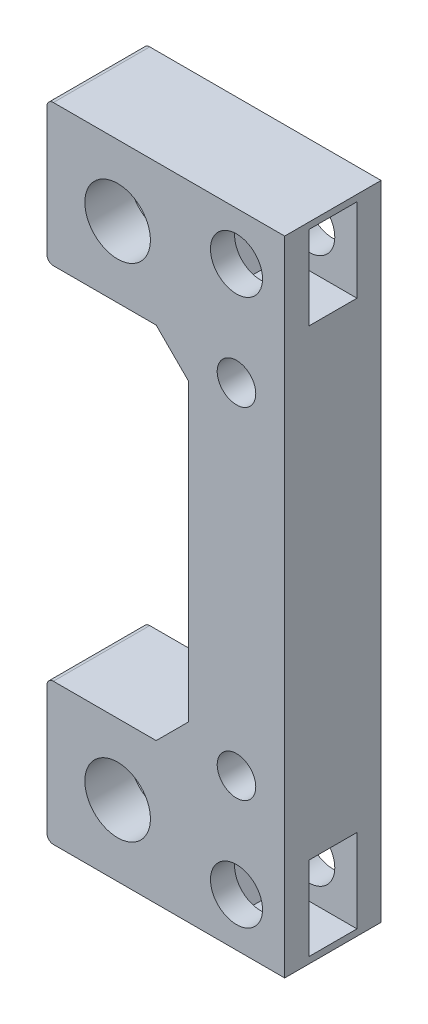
ISO-10303-21;
HEADER;
FILE_DESCRIPTION(('STEP AP214'),'2;1');
FILE_NAME('part.step','',(''),(''),'','','');
FILE_SCHEMA(('AUTOMOTIVE_DESIGN { 1 0 10303 214 1 1 1 1 }'));
ENDSEC;
DATA;
#1=APPLICATION_CONTEXT('core data for automotive mechanical design processes');
#2=APPLICATION_PROTOCOL_DEFINITION('international standard','automotive_design',2000,#1);
#3=PRODUCT_CONTEXT('',#1,'mechanical');
#4=PRODUCT('Part','Part','',(#3));
#5=PRODUCT_RELATED_PRODUCT_CATEGORY('part','',(#4));
#6=PRODUCT_DEFINITION_FORMATION('','',#4);
#7=PRODUCT_DEFINITION_CONTEXT('part definition',#1,'design');
#8=PRODUCT_DEFINITION('design','',#6,#7);
#9=PRODUCT_DEFINITION_SHAPE('','',#8);
#10=(LENGTH_UNIT() NAMED_UNIT(*) SI_UNIT(.MILLI.,.METRE.));
#11=(NAMED_UNIT(*) PLANE_ANGLE_UNIT() SI_UNIT($,.RADIAN.));
#12=(NAMED_UNIT(*) SI_UNIT($,.STERADIAN.) SOLID_ANGLE_UNIT());
#13=UNCERTAINTY_MEASURE_WITH_UNIT(LENGTH_MEASURE(1.E-05),#10,'distance_accuracy_value','');
#14=(GEOMETRIC_REPRESENTATION_CONTEXT(3) GLOBAL_UNCERTAINTY_ASSIGNED_CONTEXT((#13)) GLOBAL_UNIT_ASSIGNED_CONTEXT((#10,
#11,#12)) REPRESENTATION_CONTEXT('',''));
#15=CARTESIAN_POINT('',(0.,0.,0.));
#16=DIRECTION('',(0.,0.,1.));
#17=DIRECTION('',(1.,0.,0.));
#18=AXIS2_PLACEMENT_3D('',#15,#16,#17);
#19=CARTESIAN_POINT('',(-11.,-11.,15.));
#20=DIRECTION('',(0.,0.,-1.));
#21=DIRECTION('',(-1.,0.,0.));
#22=AXIS2_PLACEMENT_3D('',#19,#20,#21);
#23=CYLINDRICAL_SURFACE('',#22,5.1);
#24=CARTESIAN_POINT('',(-11.,-11.,15.));
#25=DIRECTION('',(0.,0.,-1.));
#26=DIRECTION('',(-1.,0.,0.));
#27=AXIS2_PLACEMENT_3D('',#24,#25,#26);
#28=CIRCLE('',#27,5.1);
#29=CARTESIAN_POINT('',(-16.1,-11.,15.));
#30=VERTEX_POINT('',#29);
#31=EDGE_CURVE('E467',#30,#30,#28,.T.);
#32=ORIENTED_EDGE('',*,*,#31,.F.);
#33=EDGE_LOOP('',(#32));
#34=FACE_BOUND('',#33,.T.);
#35=CARTESIAN_POINT('',(-11.,-11.,8.));
#36=DIRECTION('',(0.,0.,-1.));
#37=DIRECTION('',(-1.,0.,0.));
#38=AXIS2_PLACEMENT_3D('',#35,#36,#37);
#39=CIRCLE('',#38,5.1);
#40=CARTESIAN_POINT('',(-16.1,-11.,8.));
#41=VERTEX_POINT('',#40);
#42=EDGE_CURVE('E470',#41,#41,#39,.F.);
#43=ORIENTED_EDGE('',*,*,#42,.F.);
#44=EDGE_LOOP('',(#43));
#45=FACE_BOUND('',#44,.T.);
#46=ADVANCED_FACE('F37',(#34,#45),#23,.F.);
#47=CARTESIAN_POINT('',(-11.,-89.,15.));
#48=DIRECTION('',(0.,0.,-1.));
#49=DIRECTION('',(-1.,0.,0.));
#50=AXIS2_PLACEMENT_3D('',#47,#48,#49);
#51=CYLINDRICAL_SURFACE('',#50,5.1);
#52=CARTESIAN_POINT('',(-11.,-89.,15.));
#53=DIRECTION('',(0.,0.,-1.));
#54=DIRECTION('',(-1.,0.,0.));
#55=AXIS2_PLACEMENT_3D('',#52,#53,#54);
#56=CIRCLE('',#55,5.1);
#57=CARTESIAN_POINT('',(-16.1,-89.,15.));
#58=VERTEX_POINT('',#57);
#59=EDGE_CURVE('E463',#58,#58,#56,.T.);
#60=ORIENTED_EDGE('',*,*,#59,.F.);
#61=EDGE_LOOP('',(#60));
#62=FACE_BOUND('',#61,.T.);
#63=CARTESIAN_POINT('',(-11.,-89.,8.));
#64=DIRECTION('',(0.,0.,-1.));
#65=DIRECTION('',(-1.,0.,0.));
#66=AXIS2_PLACEMENT_3D('',#63,#64,#65);
#67=CIRCLE('',#66,5.1);
#68=CARTESIAN_POINT('',(-16.1,-89.,8.));
#69=VERTEX_POINT('',#68);
#70=EDGE_CURVE('E408',#69,#69,#67,.F.);
#71=ORIENTED_EDGE('',*,*,#70,.F.);
#72=EDGE_LOOP('',(#71));
#73=FACE_BOUND('',#72,.T.);
#74=ADVANCED_FACE('F875',(#62,#73),#51,.F.);
#75=CARTESIAN_POINT('',(0.,0.,15.));
#76=DIRECTION('',(1.,0.,0.));
#77=DIRECTION('',(0.,1.,0.));
#78=AXIS2_PLACEMENT_3D('',#75,#76,#77);
#79=PLANE('',#78);
#80=DIRECTION('',(0.,-1.,0.));
#81=VECTOR('',#80,1.);
#82=CARTESIAN_POINT('',(0.,0.,15.));
#83=LINE('',#82,#81);
#84=CARTESIAN_POINT('',(0.,-27.0000000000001,15.));
#85=VERTEX_POINT('',#84);
#86=CARTESIAN_POINT('',(0.,-73.,15.));
#87=VERTEX_POINT('',#86);
#88=EDGE_CURVE('E700',#85,#87,#83,.T.);
#89=ORIENTED_EDGE('',*,*,#88,.F.);
#90=DIRECTION('',(0.,0.,-1.));
#91=VECTOR('',#90,1.);
#92=CARTESIAN_POINT('',(0.,-27.0000000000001,15.));
#93=LINE('',#92,#91);
#94=CARTESIAN_POINT('',(0.,-27.0000000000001,0.));
#95=VERTEX_POINT('',#94);
#96=EDGE_CURVE('E791',#85,#95,#93,.T.);
#97=ORIENTED_EDGE('',*,*,#96,.T.);
#98=DIRECTION('',(0.,-1.,0.));
#99=VECTOR('',#98,1.);
#100=CARTESIAN_POINT('',(0.,0.,0.));
#101=LINE('',#100,#99);
#102=CARTESIAN_POINT('',(0.,-73.,0.));
#103=VERTEX_POINT('',#102);
#104=EDGE_CURVE('E695',#95,#103,#101,.T.);
#105=ORIENTED_EDGE('',*,*,#104,.T.);
#106=DIRECTION('',(0.,0.,1.));
#107=VECTOR('',#106,1.);
#108=CARTESIAN_POINT('',(0.,-73.,15.));
#109=LINE('',#108,#107);
#110=EDGE_CURVE('E789',#103,#87,#109,.T.);
#111=ORIENTED_EDGE('',*,*,#110,.T.);
#112=EDGE_LOOP('',(#89,#97,#105,#111));
#113=FACE_BOUND('',#112,.T.);
#114=ADVANCED_FACE('F807',(#113),#79,.F.);
#115=CARTESIAN_POINT('',(15.,0.,15.));
#116=DIRECTION('',(-1.,0.,0.));
#117=DIRECTION('',(0.,-1.,0.));
#118=AXIS2_PLACEMENT_3D('',#115,#116,#117);
#119=PLANE('',#118);
#120=DIRECTION('',(0.,1.,0.));
#121=VECTOR('',#120,1.);
#122=CARTESIAN_POINT('',(15.,-86.,3.75));
#123=LINE('',#122,#121);
#124=CARTESIAN_POINT('',(15.,-99.,3.75));
#125=VERTEX_POINT('',#124);
#126=CARTESIAN_POINT('',(15.,-86.,3.75));
#127=VERTEX_POINT('',#126);
#128=EDGE_CURVE('E545',#125,#127,#123,.T.);
#129=ORIENTED_EDGE('',*,*,#128,.F.);
#130=DIRECTION('',(0.,0.,1.));
#131=VECTOR('',#130,1.);
#132=CARTESIAN_POINT('',(15.,-99.,3.75));
#133=LINE('',#132,#131);
#134=CARTESIAN_POINT('',(15.,-99.,11.25));
#135=VERTEX_POINT('',#134);
#136=EDGE_CURVE('E562',#125,#135,#133,.T.);
#137=ORIENTED_EDGE('',*,*,#136,.T.);
#138=DIRECTION('',(0.,1.,0.));
#139=VECTOR('',#138,1.);
#140=CARTESIAN_POINT('',(15.,-86.,11.25));
#141=LINE('',#140,#139);
#142=CARTESIAN_POINT('',(15.,-86.,11.25));
#143=VERTEX_POINT('',#142);
#144=EDGE_CURVE('E537',#135,#143,#141,.T.);
#145=ORIENTED_EDGE('',*,*,#144,.T.);
#146=DIRECTION('',(0.,0.,1.));
#147=VECTOR('',#146,1.);
#148=CARTESIAN_POINT('',(15.,-86.,3.75));
#149=LINE('',#148,#147);
#150=EDGE_CURVE('E511',#127,#143,#149,.T.);
#151=ORIENTED_EDGE('',*,*,#150,.F.);
#152=EDGE_LOOP('',(#129,#137,#145,#151));
#153=FACE_BOUND('',#152,.T.);
#154=DIRECTION('',(0.,1.,0.));
#155=VECTOR('',#154,1.);
#156=CARTESIAN_POINT('',(15.,0.,0.));
#157=LINE('',#156,#155);
#158=CARTESIAN_POINT('',(15.,-100.,0.));
#159=VERTEX_POINT('',#158);
#160=CARTESIAN_POINT('',(15.,0.,0.));
#161=VERTEX_POINT('',#160);
#162=EDGE_CURVE('E715',#159,#161,#157,.T.);
#163=ORIENTED_EDGE('',*,*,#162,.T.);
#164=DIRECTION('',(0.,0.,-1.));
#165=VECTOR('',#164,1.);
#166=CARTESIAN_POINT('',(15.,0.,15.));
#167=LINE('',#166,#165);
#168=CARTESIAN_POINT('',(15.,0.,15.));
#169=VERTEX_POINT('',#168);
#170=EDGE_CURVE('E710',#169,#161,#167,.T.);
#171=ORIENTED_EDGE('',*,*,#170,.F.);
#172=DIRECTION('',(0.,1.,0.));
#173=VECTOR('',#172,1.);
#174=CARTESIAN_POINT('',(15.,0.,15.));
#175=LINE('',#174,#173);
#176=CARTESIAN_POINT('',(15.,-100.,15.));
#177=VERTEX_POINT('',#176);
#178=EDGE_CURVE('E705',#177,#169,#175,.T.);
#179=ORIENTED_EDGE('',*,*,#178,.F.);
#180=DIRECTION('',(0.,0.,-1.));
#181=VECTOR('',#180,1.);
#182=CARTESIAN_POINT('',(15.,-100.,15.));
#183=LINE('',#182,#181);
#184=EDGE_CURVE('E721',#177,#159,#183,.T.);
#185=ORIENTED_EDGE('',*,*,#184,.T.);
#186=EDGE_LOOP('',(#163,#171,#179,#185));
#187=FACE_BOUND('',#186,.T.);
#188=DIRECTION('',(0.,1.,0.));
#189=VECTOR('',#188,1.);
#190=CARTESIAN_POINT('',(15.,-1.,3.75));
#191=LINE('',#190,#189);
#192=CARTESIAN_POINT('',(15.,-14.,3.75));
#193=VERTEX_POINT('',#192);
#194=CARTESIAN_POINT('',(15.,-1.,3.75));
#195=VERTEX_POINT('',#194);
#196=EDGE_CURVE('E498',#193,#195,#191,.T.);
#197=ORIENTED_EDGE('',*,*,#196,.F.);
#198=DIRECTION('',(0.,0.,1.));
#199=VECTOR('',#198,1.);
#200=CARTESIAN_POINT('',(15.,-14.,3.75));
#201=LINE('',#200,#199);
#202=CARTESIAN_POINT('',(15.,-14.,11.25));
#203=VERTEX_POINT('',#202);
#204=EDGE_CURVE('E528',#193,#203,#201,.T.);
#205=ORIENTED_EDGE('',*,*,#204,.T.);
#206=DIRECTION('',(0.,1.,0.));
#207=VECTOR('',#206,1.);
#208=CARTESIAN_POINT('',(15.,-1.,11.25));
#209=LINE('',#208,#207);
#210=CARTESIAN_POINT('',(15.,-1.,11.25));
#211=VERTEX_POINT('',#210);
#212=EDGE_CURVE('E514',#203,#211,#209,.T.);
#213=ORIENTED_EDGE('',*,*,#212,.T.);
#214=DIRECTION('',(0.,0.,1.));
#215=VECTOR('',#214,1.);
#216=CARTESIAN_POINT('',(15.,-1.,3.75));
#217=LINE('',#216,#215);
#218=EDGE_CURVE('E525',#195,#211,#217,.T.);
#219=ORIENTED_EDGE('',*,*,#218,.F.);
#220=EDGE_LOOP('',(#197,#205,#213,#219));
#221=FACE_BOUND('',#220,.T.);
#222=ADVANCED_FACE('F837',(#153,#187,#221),#119,.F.);
#223=CARTESIAN_POINT('',(7.50000000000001,-92.5,0.));
#224=DIRECTION('',(0.,0.,1.));
#225=DIRECTION('',(1.,0.,0.));
#226=AXIS2_PLACEMENT_3D('',#223,#224,#225);
#227=CYLINDRICAL_SURFACE('',#226,4.05);
#228=CARTESIAN_POINT('',(7.50000000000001,-92.5,0.));
#229=DIRECTION('',(0.,0.,1.));
#230=DIRECTION('',(1.,0.,0.));
#231=AXIS2_PLACEMENT_3D('',#228,#229,#230);
#232=CIRCLE('',#231,4.05);
#233=CARTESIAN_POINT('',(11.55,-92.5,0.));
#234=VERTEX_POINT('',#233);
#235=EDGE_CURVE('E591',#234,#234,#232,.T.);
#236=ORIENTED_EDGE('',*,*,#235,.F.);
#237=EDGE_LOOP('',(#236));
#238=FACE_BOUND('',#237,.T.);
#239=CARTESIAN_POINT('',(7.50000000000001,-92.5,3.75));
#240=DIRECTION('',(0.,0.,1.));
#241=DIRECTION('',(1.,0.,0.));
#242=AXIS2_PLACEMENT_3D('',#239,#240,#241);
#243=CIRCLE('',#242,4.05);
#244=CARTESIAN_POINT('',(11.55,-92.5,3.75));
#245=VERTEX_POINT('',#244);
#246=EDGE_CURVE('E579',#245,#245,#243,.F.);
#247=ORIENTED_EDGE('',*,*,#246,.F.);
#248=EDGE_LOOP('',(#247));
#249=FACE_BOUND('',#248,.T.);
#250=ADVANCED_FACE('F1011',(#238,#249),#227,.F.);
#251=CARTESIAN_POINT('',(7.50000000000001,-7.5,0.));
#252=DIRECTION('',(0.,0.,1.));
#253=DIRECTION('',(1.,0.,0.));
#254=AXIS2_PLACEMENT_3D('',#251,#252,#253);
#255=CYLINDRICAL_SURFACE('',#254,4.05);
#256=CARTESIAN_POINT('',(7.50000000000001,-7.5,0.));
#257=DIRECTION('',(0.,0.,1.));
#258=DIRECTION('',(1.,0.,0.));
#259=AXIS2_PLACEMENT_3D('',#256,#257,#258);
#260=CIRCLE('',#259,4.05);
#261=CARTESIAN_POINT('',(11.55,-7.5,0.));
#262=VERTEX_POINT('',#261);
#263=EDGE_CURVE('E584',#262,#262,#260,.T.);
#264=ORIENTED_EDGE('',*,*,#263,.F.);
#265=EDGE_LOOP('',(#264));
#266=FACE_BOUND('',#265,.T.);
#267=CARTESIAN_POINT('',(7.50000000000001,-7.5,3.75));
#268=DIRECTION('',(0.,0.,1.));
#269=DIRECTION('',(1.,0.,0.));
#270=AXIS2_PLACEMENT_3D('',#267,#268,#269);
#271=CIRCLE('',#270,4.05);
#272=CARTESIAN_POINT('',(11.55,-7.5,3.75));
#273=VERTEX_POINT('',#272);
#274=EDGE_CURVE('E572',#273,#273,#271,.F.);
#275=ORIENTED_EDGE('',*,*,#274,.F.);
#276=EDGE_LOOP('',(#275));
#277=FACE_BOUND('',#276,.T.);
#278=ADVANCED_FACE('F999',(#266,#277),#255,.F.);
#279=CARTESIAN_POINT('',(7.50000000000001,-76.5,-22.));
#280=DIRECTION('',(0.,0.,1.));
#281=DIRECTION('',(1.,0.,0.));
#282=AXIS2_PLACEMENT_3D('',#279,#280,#281);
#283=CYLINDRICAL_SURFACE('',#282,3.);
#284=CARTESIAN_POINT('',(7.50000000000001,-76.5,15.));
#285=DIRECTION('',(0.,0.,1.));
#286=DIRECTION('',(1.,0.,0.));
#287=AXIS2_PLACEMENT_3D('',#284,#285,#286);
#288=CIRCLE('',#287,3.);
#289=CARTESIAN_POINT('',(10.5,-76.5,15.));
#290=VERTEX_POINT('',#289);
#291=EDGE_CURVE('E696',#290,#290,#288,.T.);
#292=ORIENTED_EDGE('',*,*,#291,.T.);
#293=EDGE_LOOP('',(#292));
#294=FACE_BOUND('',#293,.T.);
#295=CARTESIAN_POINT('',(7.50000000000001,-76.5,10.));
#296=DIRECTION('',(0.,0.,-1.));
#297=DIRECTION('',(-1.,0.,0.));
#298=AXIS2_PLACEMENT_3D('',#295,#296,#297);
#299=CIRCLE('',#298,3.);
#300=CARTESIAN_POINT('',(4.50000000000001,-76.5,10.));
#301=VERTEX_POINT('',#300);
#302=EDGE_CURVE('E699',#301,#301,#299,.F.);
#303=ORIENTED_EDGE('',*,*,#302,.F.);
#304=EDGE_LOOP('',(#303));
#305=FACE_BOUND('',#304,.T.);
#306=ADVANCED_FACE('F991',(#294,#305),#283,.F.);
#307=CARTESIAN_POINT('',(7.50000000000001,-23.5,-22.));
#308=DIRECTION('',(0.,0.,1.));
#309=DIRECTION('',(1.,0.,0.));
#310=AXIS2_PLACEMENT_3D('',#307,#308,#309);
#311=CYLINDRICAL_SURFACE('',#310,3.);
#312=CARTESIAN_POINT('',(7.50000000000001,-23.5,15.));
#313=DIRECTION('',(0.,0.,1.));
#314=DIRECTION('',(1.,0.,0.));
#315=AXIS2_PLACEMENT_3D('',#312,#313,#314);
#316=CIRCLE('',#315,3.);
#317=CARTESIAN_POINT('',(10.5,-23.5,15.));
#318=VERTEX_POINT('',#317);
#319=EDGE_CURVE('E692',#318,#318,#316,.T.);
#320=ORIENTED_EDGE('',*,*,#319,.T.);
#321=EDGE_LOOP('',(#320));
#322=FACE_BOUND('',#321,.T.);
#323=CARTESIAN_POINT('',(7.50000000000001,-23.5,10.));
#324=DIRECTION('',(0.,0.,-1.));
#325=DIRECTION('',(-1.,0.,0.));
#326=AXIS2_PLACEMENT_3D('',#323,#324,#325);
#327=CIRCLE('',#326,3.);
#328=CARTESIAN_POINT('',(4.50000000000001,-23.5,10.));
#329=VERTEX_POINT('',#328);
#330=EDGE_CURVE('E635',#329,#329,#327,.F.);
#331=ORIENTED_EDGE('',*,*,#330,.F.);
#332=EDGE_LOOP('',(#331));
#333=FACE_BOUND('',#332,.T.);
#334=ADVANCED_FACE('F989',(#322,#333),#311,.F.);
#335=CARTESIAN_POINT('',(0.,-100.,15.));
#336=DIRECTION('',(0.,1.,0.));
#337=DIRECTION('',(0.,0.,1.));
#338=AXIS2_PLACEMENT_3D('',#335,#336,#337);
#339=PLANE('',#338);
#340=DIRECTION('',(1.,0.,0.));
#341=VECTOR('',#340,1.);
#342=CARTESIAN_POINT('',(0.,-100.,15.));
#343=LINE('',#342,#341);
#344=CARTESIAN_POINT('',(-21.,-100.,15.));
#345=VERTEX_POINT('',#344);
#346=EDGE_CURVE('E702',#345,#177,#343,.T.);
#347=ORIENTED_EDGE('',*,*,#346,.F.);
#348=DIRECTION('',(0.,0.,-1.));
#349=VECTOR('',#348,1.);
#350=CARTESIAN_POINT('',(-21.,-100.,0.));
#351=LINE('',#350,#349);
#352=CARTESIAN_POINT('',(-21.,-100.,0.));
#353=VERTEX_POINT('',#352);
#354=EDGE_CURVE('E786',#345,#353,#351,.T.);
#355=ORIENTED_EDGE('',*,*,#354,.T.);
#356=DIRECTION('',(1.,0.,0.));
#357=VECTOR('',#356,1.);
#358=CARTESIAN_POINT('',(0.,-100.,0.));
#359=LINE('',#358,#357);
#360=EDGE_CURVE('E713',#353,#159,#359,.T.);
#361=ORIENTED_EDGE('',*,*,#360,.T.);
#362=ORIENTED_EDGE('',*,*,#184,.F.);
#363=EDGE_LOOP('',(#347,#355,#361,#362));
#364=FACE_BOUND('',#363,.T.);
#365=ADVANCED_FACE('F830',(#364),#339,.F.);
#366=CARTESIAN_POINT('',(0.,0.,15.));
#367=DIRECTION('',(0.,-1.,0.));
#368=DIRECTION('',(1.,0.,0.));
#369=AXIS2_PLACEMENT_3D('',#366,#367,#368);
#370=PLANE('',#369);
#371=DIRECTION('',(-1.,0.,0.));
#372=VECTOR('',#371,1.);
#373=CARTESIAN_POINT('',(0.,0.,0.));
#374=LINE('',#373,#372);
#375=CARTESIAN_POINT('',(-21.,0.,0.));
#376=VERTEX_POINT('',#375);
#377=EDGE_CURVE('E703',#161,#376,#374,.T.);
#378=ORIENTED_EDGE('',*,*,#377,.T.);
#379=DIRECTION('',(0.,0.,-1.));
#380=VECTOR('',#379,1.);
#381=CARTESIAN_POINT('',(-21.,0.,15.));
#382=LINE('',#381,#380);
#383=CARTESIAN_POINT('',(-21.,0.,15.));
#384=VERTEX_POINT('',#383);
#385=EDGE_CURVE('E765',#376,#384,#382,.F.);
#386=ORIENTED_EDGE('',*,*,#385,.T.);
#387=DIRECTION('',(-1.,0.,0.));
#388=VECTOR('',#387,1.);
#389=CARTESIAN_POINT('',(0.,0.,15.));
#390=LINE('',#389,#388);
#391=EDGE_CURVE('E707',#169,#384,#390,.T.);
#392=ORIENTED_EDGE('',*,*,#391,.F.);
#393=ORIENTED_EDGE('',*,*,#170,.T.);
#394=EDGE_LOOP('',(#378,#386,#392,#393));
#395=FACE_BOUND('',#394,.T.);
#396=ADVANCED_FACE('F841',(#395),#370,.F.);
#397=CARTESIAN_POINT('',(0.,0.,15.));
#398=DIRECTION('',(0.,0.,1.));
#399=DIRECTION('',(1.,0.,0.));
#400=AXIS2_PLACEMENT_3D('',#397,#398,#399);
#401=PLANE('',#400);
#402=ORIENTED_EDGE('',*,*,#59,.T.);
#403=EDGE_LOOP('',(#402));
#404=FACE_BOUND('',#403,.T.);
#405=ORIENTED_EDGE('',*,*,#31,.T.);
#406=EDGE_LOOP('',(#405));
#407=FACE_BOUND('',#406,.T.);
#408=CARTESIAN_POINT('',(7.50000000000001,-7.5,15.));
#409=DIRECTION('',(0.,0.,1.));
#410=DIRECTION('',(1.,0.,0.));
#411=AXIS2_PLACEMENT_3D('',#408,#409,#410);
#412=CIRCLE('',#411,4.05);
#413=CARTESIAN_POINT('',(11.55,-7.5,15.));
#414=VERTEX_POINT('',#413);
#415=EDGE_CURVE('E588',#414,#414,#412,.T.);
#416=ORIENTED_EDGE('',*,*,#415,.F.);
#417=EDGE_LOOP('',(#416));
#418=FACE_BOUND('',#417,.T.);
#419=CARTESIAN_POINT('',(7.50000000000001,-92.5,15.));
#420=DIRECTION('',(0.,0.,1.));
#421=DIRECTION('',(1.,0.,0.));
#422=AXIS2_PLACEMENT_3D('',#419,#420,#421);
#423=CIRCLE('',#422,4.05);
#424=CARTESIAN_POINT('',(11.55,-92.5,15.));
#425=VERTEX_POINT('',#424);
#426=EDGE_CURVE('E583',#425,#425,#423,.T.);
#427=ORIENTED_EDGE('',*,*,#426,.F.);
#428=EDGE_LOOP('',(#427));
#429=FACE_BOUND('',#428,.T.);
#430=ORIENTED_EDGE('',*,*,#319,.F.);
#431=EDGE_LOOP('',(#430));
#432=FACE_BOUND('',#431,.T.);
#433=ORIENTED_EDGE('',*,*,#291,.F.);
#434=EDGE_LOOP('',(#433));
#435=FACE_BOUND('',#434,.T.);
#436=ORIENTED_EDGE('',*,*,#391,.T.);
#437=CARTESIAN_POINT('',(-21.,-0.999999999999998,15.));
#438=DIRECTION('',(0.,0.,1.));
#439=DIRECTION('',(1.,0.,0.));
#440=AXIS2_PLACEMENT_3D('',#437,#438,#439);
#441=CIRCLE('',#440,1.);
#442=CARTESIAN_POINT('',(-22.,-0.999999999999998,15.));
#443=VERTEX_POINT('',#442);
#444=EDGE_CURVE('E774',#384,#443,#441,.T.);
#445=ORIENTED_EDGE('',*,*,#444,.T.);
#446=DIRECTION('',(0.,1.,0.));
#447=VECTOR('',#446,1.);
#448=CARTESIAN_POINT('',(-22.,0.,15.));
#449=LINE('',#448,#447);
#450=CARTESIAN_POINT('',(-22.,-21.,15.));
#451=VERTEX_POINT('',#450);
#452=EDGE_CURVE('E473',#451,#443,#449,.T.);
#453=ORIENTED_EDGE('',*,*,#452,.F.);
#454=CARTESIAN_POINT('',(-21.,-21.,15.));
#455=DIRECTION('',(0.,0.,1.));
#456=DIRECTION('',(1.,0.,0.));
#457=AXIS2_PLACEMENT_3D('',#454,#455,#456);
#458=CIRCLE('',#457,1.);
#459=CARTESIAN_POINT('',(-21.,-22.,15.));
#460=VERTEX_POINT('',#459);
#461=EDGE_CURVE('E771',#451,#460,#458,.T.);
#462=ORIENTED_EDGE('',*,*,#461,.T.);
#463=DIRECTION('',(-1.,0.,0.));
#464=VECTOR('',#463,1.);
#465=CARTESIAN_POINT('',(0.,-22.,15.));
#466=LINE('',#465,#464);
#467=CARTESIAN_POINT('',(-5.,-22.,15.));
#468=VERTEX_POINT('',#467);
#469=EDGE_CURVE('E471',#468,#460,#466,.T.);
#470=ORIENTED_EDGE('',*,*,#469,.F.);
#471=DIRECTION('',(0.707106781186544,-0.707106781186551,0.));
#472=VECTOR('',#471,1.);
#473=CARTESIAN_POINT('',(0.,-27.0000000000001,15.));
#474=LINE('',#473,#472);
#475=EDGE_CURVE('E800',#468,#85,#474,.T.);
#476=ORIENTED_EDGE('',*,*,#475,.T.);
#477=ORIENTED_EDGE('',*,*,#88,.T.);
#478=DIRECTION('',(-0.707106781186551,-0.707106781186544,0.));
#479=VECTOR('',#478,1.);
#480=CARTESIAN_POINT('',(-5.00000000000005,-78.,15.));
#481=LINE('',#480,#479);
#482=CARTESIAN_POINT('',(-5.00000000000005,-78.,15.));
#483=VERTEX_POINT('',#482);
#484=EDGE_CURVE('E11',#87,#483,#481,.T.);
#485=ORIENTED_EDGE('',*,*,#484,.T.);
#486=DIRECTION('',(1.,0.,0.));
#487=VECTOR('',#486,1.);
#488=CARTESIAN_POINT('',(0.,-78.,15.));
#489=LINE('',#488,#487);
#490=CARTESIAN_POINT('',(-21.,-78.,15.));
#491=VERTEX_POINT('',#490);
#492=EDGE_CURVE('E484',#491,#483,#489,.T.);
#493=ORIENTED_EDGE('',*,*,#492,.F.);
#494=CARTESIAN_POINT('',(-21.,-79.,15.));
#495=DIRECTION('',(0.,0.,1.));
#496=DIRECTION('',(1.,0.,0.));
#497=AXIS2_PLACEMENT_3D('',#494,#495,#496);
#498=CIRCLE('',#497,1.);
#499=CARTESIAN_POINT('',(-22.,-79.,15.));
#500=VERTEX_POINT('',#499);
#501=EDGE_CURVE('E769',#491,#500,#498,.T.);
#502=ORIENTED_EDGE('',*,*,#501,.T.);
#503=DIRECTION('',(0.,1.,0.));
#504=VECTOR('',#503,1.);
#505=CARTESIAN_POINT('',(-22.,-100.,15.));
#506=LINE('',#505,#504);
#507=CARTESIAN_POINT('',(-22.,-99.,15.));
#508=VERTEX_POINT('',#507);
#509=EDGE_CURVE('E481',#508,#500,#506,.T.);
#510=ORIENTED_EDGE('',*,*,#509,.F.);
#511=CARTESIAN_POINT('',(-21.,-99.,15.));
#512=DIRECTION('',(0.,0.,1.));
#513=DIRECTION('',(1.,0.,0.));
#514=AXIS2_PLACEMENT_3D('',#511,#512,#513);
#515=CIRCLE('',#514,1.);
#516=EDGE_CURVE('E767',#508,#345,#515,.T.);
#517=ORIENTED_EDGE('',*,*,#516,.T.);
#518=ORIENTED_EDGE('',*,*,#346,.T.);
#519=ORIENTED_EDGE('',*,*,#178,.T.);
#520=EDGE_LOOP('',(#436,#445,#453,#462,#470,#476,#477,#485,#493,#502,#510,#517,#518,#519));
#521=FACE_BOUND('',#520,.T.);
#522=ADVANCED_FACE('F813',(#404,#407,#418,#429,#432,#435,#521),#401,.T.);
#523=CARTESIAN_POINT('',(0.,0.,0.));
#524=DIRECTION('',(0.,0.,1.));
#525=DIRECTION('',(1.,0.,0.));
#526=AXIS2_PLACEMENT_3D('',#523,#524,#525);
#527=PLANE('',#526);
#528=DIRECTION('',(0.866025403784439,-0.499999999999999,0.));
#529=VECTOR('',#528,1.);
#530=CARTESIAN_POINT('',(-11.,-79.762395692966,0.));
#531=LINE('',#530,#529);
#532=CARTESIAN_POINT('',(-11.,-79.762395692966,0.));
#533=VERTEX_POINT('',#532);
#534=CARTESIAN_POINT('',(-3.,-84.381197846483,0.));
#535=VERTEX_POINT('',#534);
#536=EDGE_CURVE('E395',#533,#535,#531,.T.);
#537=ORIENTED_EDGE('',*,*,#536,.F.);
#538=DIRECTION('',(0.866025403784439,0.5,0.));
#539=VECTOR('',#538,1.);
#540=CARTESIAN_POINT('',(-19.,-84.381197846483,0.));
#541=LINE('',#540,#539);
#542=CARTESIAN_POINT('',(-19.,-84.381197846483,0.));
#543=VERTEX_POINT('',#542);
#544=EDGE_CURVE('E362',#543,#533,#541,.T.);
#545=ORIENTED_EDGE('',*,*,#544,.F.);
#546=DIRECTION('',(0.,1.,0.));
#547=VECTOR('',#546,1.);
#548=CARTESIAN_POINT('',(-19.,-93.6188021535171,0.));
#549=LINE('',#548,#547);
#550=CARTESIAN_POINT('',(-19.,-93.6188021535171,0.));
#551=VERTEX_POINT('',#550);
#552=EDGE_CURVE('E381',#551,#543,#549,.T.);
#553=ORIENTED_EDGE('',*,*,#552,.F.);
#554=DIRECTION('',(-0.866025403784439,0.5,0.));
#555=VECTOR('',#554,1.);
#556=CARTESIAN_POINT('',(-11.,-98.237604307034,0.));
#557=LINE('',#556,#555);
#558=CARTESIAN_POINT('',(-11.,-98.237604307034,0.));
#559=VERTEX_POINT('',#558);
#560=EDGE_CURVE('E384',#559,#551,#557,.T.);
#561=ORIENTED_EDGE('',*,*,#560,.F.);
#562=DIRECTION('',(-0.866025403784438,-0.500000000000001,0.));
#563=VECTOR('',#562,1.);
#564=CARTESIAN_POINT('',(-3.,-93.618802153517,0.));
#565=LINE('',#564,#563);
#566=CARTESIAN_POINT('',(-3.,-93.618802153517,0.));
#567=VERTEX_POINT('',#566);
#568=EDGE_CURVE('E401',#567,#559,#565,.T.);
#569=ORIENTED_EDGE('',*,*,#568,.F.);
#570=DIRECTION('',(0.,-1.,0.));
#571=VECTOR('',#570,1.);
#572=CARTESIAN_POINT('',(-3.,-84.381197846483,0.));
#573=LINE('',#572,#571);
#574=EDGE_CURVE('E398',#535,#567,#573,.T.);
#575=ORIENTED_EDGE('',*,*,#574,.F.);
#576=EDGE_LOOP('',(#537,#545,#553,#561,#569,#575));
#577=FACE_BOUND('',#576,.T.);
#578=DIRECTION('',(0.866025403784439,0.5,0.));
#579=VECTOR('',#578,1.);
#580=CARTESIAN_POINT('',(-19.,-6.38119784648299,0.));
#581=LINE('',#580,#579);
#582=CARTESIAN_POINT('',(-19.,-6.381197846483,0.));
#583=VERTEX_POINT('',#582);
#584=CARTESIAN_POINT('',(-11.,-1.76239569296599,0.));
#585=VERTEX_POINT('',#584);
#586=EDGE_CURVE('E438',#583,#585,#581,.T.);
#587=ORIENTED_EDGE('',*,*,#586,.F.);
#588=DIRECTION('',(0.,1.,0.));
#589=VECTOR('',#588,1.);
#590=CARTESIAN_POINT('',(-19.,-15.618802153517,0.));
#591=LINE('',#590,#589);
#592=CARTESIAN_POINT('',(-19.,-15.618802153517,0.));
#593=VERTEX_POINT('',#592);
#594=EDGE_CURVE('E436',#593,#583,#591,.T.);
#595=ORIENTED_EDGE('',*,*,#594,.F.);
#596=DIRECTION('',(-0.866025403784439,0.5,0.));
#597=VECTOR('',#596,1.);
#598=CARTESIAN_POINT('',(-11.,-20.237604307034,0.));
#599=LINE('',#598,#597);
#600=CARTESIAN_POINT('',(-11.,-20.237604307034,0.));
#601=VERTEX_POINT('',#600);
#602=EDGE_CURVE('E420',#601,#593,#599,.T.);
#603=ORIENTED_EDGE('',*,*,#602,.F.);
#604=DIRECTION('',(-0.866025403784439,-0.5,0.));
#605=VECTOR('',#604,1.);
#606=CARTESIAN_POINT('',(-3.00000000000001,-15.618802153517,0.));
#607=LINE('',#606,#605);
#608=CARTESIAN_POINT('',(-3.00000000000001,-15.618802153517,0.));
#609=VERTEX_POINT('',#608);
#610=EDGE_CURVE('E447',#609,#601,#607,.T.);
#611=ORIENTED_EDGE('',*,*,#610,.F.);
#612=DIRECTION('',(0.,-1.,0.));
#613=VECTOR('',#612,1.);
#614=CARTESIAN_POINT('',(-3.00000000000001,-6.38119784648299,0.));
#615=LINE('',#614,#613);
#616=CARTESIAN_POINT('',(-3.00000000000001,-6.38119784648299,0.));
#617=VERTEX_POINT('',#616);
#618=EDGE_CURVE('E444',#617,#609,#615,.T.);
#619=ORIENTED_EDGE('',*,*,#618,.F.);
#620=DIRECTION('',(0.866025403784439,-0.5,0.));
#621=VECTOR('',#620,1.);
#622=CARTESIAN_POINT('',(-11.,-1.76239569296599,0.));
#623=LINE('',#622,#621);
#624=EDGE_CURVE('E441',#585,#617,#623,.T.);
#625=ORIENTED_EDGE('',*,*,#624,.F.);
#626=EDGE_LOOP('',(#587,#595,#603,#611,#619,#625));
#627=FACE_BOUND('',#626,.T.);
#628=ORIENTED_EDGE('',*,*,#263,.T.);
#629=EDGE_LOOP('',(#628));
#630=FACE_BOUND('',#629,.T.);
#631=ORIENTED_EDGE('',*,*,#235,.T.);
#632=EDGE_LOOP('',(#631));
#633=FACE_BOUND('',#632,.T.);
#634=DIRECTION('',(0.866025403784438,-0.5,0.));
#635=VECTOR('',#634,1.);
#636=CARTESIAN_POINT('',(7.50000000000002,-70.7264973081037,0.));
#637=LINE('',#636,#635);
#638=CARTESIAN_POINT('',(7.50000000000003,-70.7264973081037,0.));
#639=VERTEX_POINT('',#638);
#640=CARTESIAN_POINT('',(12.5,-73.6132486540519,0.));
#641=VERTEX_POINT('',#640);
#642=EDGE_CURVE('E618',#639,#641,#637,.T.);
#643=ORIENTED_EDGE('',*,*,#642,.F.);
#644=DIRECTION('',(0.866025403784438,0.5,0.));
#645=VECTOR('',#644,1.);
#646=CARTESIAN_POINT('',(2.50000000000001,-73.6132486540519,0.));
#647=LINE('',#646,#645);
#648=CARTESIAN_POINT('',(2.50000000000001,-73.6132486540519,0.));
#649=VERTEX_POINT('',#648);
#650=EDGE_CURVE('E616',#649,#639,#647,.T.);
#651=ORIENTED_EDGE('',*,*,#650,.F.);
#652=DIRECTION('',(0.,1.,0.));
#653=VECTOR('',#652,1.);
#654=CARTESIAN_POINT('',(2.50000000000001,-79.3867513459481,0.));
#655=LINE('',#654,#653);
#656=CARTESIAN_POINT('',(2.50000000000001,-79.3867513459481,0.));
#657=VERTEX_POINT('',#656);
#658=EDGE_CURVE('E600',#657,#649,#655,.T.);
#659=ORIENTED_EDGE('',*,*,#658,.F.);
#660=DIRECTION('',(-0.866025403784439,0.499999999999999,0.));
#661=VECTOR('',#660,1.);
#662=CARTESIAN_POINT('',(7.50000000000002,-82.2735026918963,0.));
#663=LINE('',#662,#661);
#664=CARTESIAN_POINT('',(7.50000000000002,-82.2735026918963,0.));
#665=VERTEX_POINT('',#664);
#666=EDGE_CURVE('E628',#665,#657,#663,.T.);
#667=ORIENTED_EDGE('',*,*,#666,.F.);
#668=DIRECTION('',(-0.866025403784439,-0.5,0.));
#669=VECTOR('',#668,1.);
#670=CARTESIAN_POINT('',(12.5,-79.3867513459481,0.));
#671=LINE('',#670,#669);
#672=CARTESIAN_POINT('',(12.5,-79.3867513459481,0.));
#673=VERTEX_POINT('',#672);
#674=EDGE_CURVE('E625',#673,#665,#671,.T.);
#675=ORIENTED_EDGE('',*,*,#674,.F.);
#676=DIRECTION('',(0.,-1.,0.));
#677=VECTOR('',#676,1.);
#678=CARTESIAN_POINT('',(12.5,-73.6132486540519,0.));
#679=LINE('',#678,#677);
#680=EDGE_CURVE('E622',#641,#673,#679,.T.);
#681=ORIENTED_EDGE('',*,*,#680,.F.);
#682=EDGE_LOOP('',(#643,#651,#659,#667,#675,#681));
#683=FACE_BOUND('',#682,.T.);
#684=DIRECTION('',(0.866025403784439,-0.499999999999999,0.));
#685=VECTOR('',#684,1.);
#686=CARTESIAN_POINT('',(7.5,-17.7264973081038,0.));
#687=LINE('',#686,#685);
#688=CARTESIAN_POINT('',(7.5,-17.7264973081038,0.));
#689=VERTEX_POINT('',#688);
#690=CARTESIAN_POINT('',(12.5,-20.6132486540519,0.));
#691=VERTEX_POINT('',#690);
#692=EDGE_CURVE('E667',#689,#691,#687,.T.);
#693=ORIENTED_EDGE('',*,*,#692,.F.);
#694=DIRECTION('',(0.866025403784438,0.5,0.));
#695=VECTOR('',#694,1.);
#696=CARTESIAN_POINT('',(2.50000000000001,-20.6132486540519,0.));
#697=LINE('',#696,#695);
#698=CARTESIAN_POINT('',(2.50000000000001,-20.6132486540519,0.));
#699=VERTEX_POINT('',#698);
#700=EDGE_CURVE('E587',#699,#689,#697,.T.);
#701=ORIENTED_EDGE('',*,*,#700,.F.);
#702=DIRECTION('',(0.,1.,0.));
#703=VECTOR('',#702,1.);
#704=CARTESIAN_POINT('',(2.50000000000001,-26.3867513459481,0.));
#705=LINE('',#704,#703);
#706=CARTESIAN_POINT('',(2.50000000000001,-26.3867513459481,0.));
#707=VERTEX_POINT('',#706);
#708=EDGE_CURVE('E650',#707,#699,#705,.T.);
#709=ORIENTED_EDGE('',*,*,#708,.F.);
#710=DIRECTION('',(-0.866025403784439,0.5,0.));
#711=VECTOR('',#710,1.);
#712=CARTESIAN_POINT('',(7.50000000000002,-29.2735026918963,0.));
#713=LINE('',#712,#711);
#714=CARTESIAN_POINT('',(7.50000000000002,-29.2735026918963,0.));
#715=VERTEX_POINT('',#714);
#716=EDGE_CURVE('E676',#715,#707,#713,.T.);
#717=ORIENTED_EDGE('',*,*,#716,.F.);
#718=DIRECTION('',(-0.866025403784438,-0.5,0.));
#719=VECTOR('',#718,1.);
#720=CARTESIAN_POINT('',(12.5,-26.3867513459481,0.));
#721=LINE('',#720,#719);
#722=CARTESIAN_POINT('',(12.5,-26.3867513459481,0.));
#723=VERTEX_POINT('',#722);
#724=EDGE_CURVE('E673',#723,#715,#721,.T.);
#725=ORIENTED_EDGE('',*,*,#724,.F.);
#726=DIRECTION('',(0.,-1.,0.));
#727=VECTOR('',#726,1.);
#728=CARTESIAN_POINT('',(12.5,-20.6132486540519,0.));
#729=LINE('',#728,#727);
#730=EDGE_CURVE('E670',#691,#723,#729,.T.);
#731=ORIENTED_EDGE('',*,*,#730,.F.);
#732=EDGE_LOOP('',(#693,#701,#709,#717,#725,#731));
#733=FACE_BOUND('',#732,.T.);
#734=DIRECTION('',(0.,1.,0.));
#735=VECTOR('',#734,1.);
#736=CARTESIAN_POINT('',(-22.,0.,0.));
#737=LINE('',#736,#735);
#738=CARTESIAN_POINT('',(-22.,-21.,0.));
#739=VERTEX_POINT('',#738);
#740=CARTESIAN_POINT('',(-22.,-0.999999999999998,0.));
#741=VERTEX_POINT('',#740);
#742=EDGE_CURVE('E474',#739,#741,#737,.T.);
#743=ORIENTED_EDGE('',*,*,#742,.T.);
#744=CARTESIAN_POINT('',(-21.,-0.999999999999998,0.));
#745=DIRECTION('',(0.,0.,1.));
#746=DIRECTION('',(1.,0.,0.));
#747=AXIS2_PLACEMENT_3D('',#744,#745,#746);
#748=CIRCLE('',#747,1.);
#749=EDGE_CURVE('E763',#741,#376,#748,.F.);
#750=ORIENTED_EDGE('',*,*,#749,.T.);
#751=ORIENTED_EDGE('',*,*,#377,.F.);
#752=ORIENTED_EDGE('',*,*,#162,.F.);
#753=ORIENTED_EDGE('',*,*,#360,.F.);
#754=CARTESIAN_POINT('',(-21.,-99.,0.));
#755=DIRECTION('',(0.,0.,1.));
#756=DIRECTION('',(1.,0.,0.));
#757=AXIS2_PLACEMENT_3D('',#754,#755,#756);
#758=CIRCLE('',#757,1.);
#759=CARTESIAN_POINT('',(-22.,-99.,0.));
#760=VERTEX_POINT('',#759);
#761=EDGE_CURVE('E757',#353,#760,#758,.F.);
#762=ORIENTED_EDGE('',*,*,#761,.T.);
#763=DIRECTION('',(0.,1.,0.));
#764=VECTOR('',#763,1.);
#765=CARTESIAN_POINT('',(-22.,-100.,0.));
#766=LINE('',#765,#764);
#767=CARTESIAN_POINT('',(-22.,-79.,0.));
#768=VERTEX_POINT('',#767);
#769=EDGE_CURVE('E477',#760,#768,#766,.T.);
#770=ORIENTED_EDGE('',*,*,#769,.T.);
#771=CARTESIAN_POINT('',(-21.,-79.,0.));
#772=DIRECTION('',(0.,0.,1.));
#773=DIRECTION('',(1.,0.,0.));
#774=AXIS2_PLACEMENT_3D('',#771,#772,#773);
#775=CIRCLE('',#774,1.);
#776=CARTESIAN_POINT('',(-21.,-78.,0.));
#777=VERTEX_POINT('',#776);
#778=EDGE_CURVE('E759',#768,#777,#775,.F.);
#779=ORIENTED_EDGE('',*,*,#778,.T.);
#780=DIRECTION('',(1.,0.,0.));
#781=VECTOR('',#780,1.);
#782=CARTESIAN_POINT('',(0.,-78.,0.));
#783=LINE('',#782,#781);
#784=CARTESIAN_POINT('',(-5.00000000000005,-78.,0.));
#785=VERTEX_POINT('',#784);
#786=EDGE_CURVE('E485',#777,#785,#783,.T.);
#787=ORIENTED_EDGE('',*,*,#786,.T.);
#788=DIRECTION('',(0.707106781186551,0.707106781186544,0.));
#789=VECTOR('',#788,1.);
#790=CARTESIAN_POINT('',(36.5,-36.5000000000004,0.));
#791=LINE('',#790,#789);
#792=EDGE_CURVE('E46',#785,#103,#791,.T.);
#793=ORIENTED_EDGE('',*,*,#792,.T.);
#794=ORIENTED_EDGE('',*,*,#104,.F.);
#795=DIRECTION('',(-0.707106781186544,0.707106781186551,0.));
#796=VECTOR('',#795,1.);
#797=CARTESIAN_POINT('',(-13.5,-13.4999999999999,0.));
#798=LINE('',#797,#796);
#799=CARTESIAN_POINT('',(-5.,-22.,0.));
#800=VERTEX_POINT('',#799);
#801=EDGE_CURVE('E798',#95,#800,#798,.T.);
#802=ORIENTED_EDGE('',*,*,#801,.T.);
#803=DIRECTION('',(-1.,0.,0.));
#804=VECTOR('',#803,1.);
#805=CARTESIAN_POINT('',(0.,-22.,0.));
#806=LINE('',#805,#804);
#807=CARTESIAN_POINT('',(-21.,-22.,0.));
#808=VERTEX_POINT('',#807);
#809=EDGE_CURVE('E466',#800,#808,#806,.T.);
#810=ORIENTED_EDGE('',*,*,#809,.T.);
#811=CARTESIAN_POINT('',(-21.,-21.,0.));
#812=DIRECTION('',(0.,0.,1.));
#813=DIRECTION('',(1.,0.,0.));
#814=AXIS2_PLACEMENT_3D('',#811,#812,#813);
#815=CIRCLE('',#814,1.);
#816=EDGE_CURVE('E761',#808,#739,#815,.F.);
#817=ORIENTED_EDGE('',*,*,#816,.T.);
#818=EDGE_LOOP('',(#743,#750,#751,#752,#753,#762,#770,#779,#787,#793,#794,#802,#810,#817));
#819=FACE_BOUND('',#818,.T.);
#820=ADVANCED_FACE('F803',(#577,#627,#630,#633,#683,#733,#819),#527,.F.);
#821=CARTESIAN_POINT('',(0.,0.,10.));
#822=DIRECTION('',(0.,0.,-1.));
#823=DIRECTION('',(-1.,0.,0.));
#824=AXIS2_PLACEMENT_3D('',#821,#822,#823);
#825=PLANE('',#824);
#826=DIRECTION('',(0.866025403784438,0.5,0.));
#827=VECTOR('',#826,1.);
#828=CARTESIAN_POINT('',(2.50000000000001,-20.6132486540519,10.));
#829=LINE('',#828,#827);
#830=CARTESIAN_POINT('',(2.50000000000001,-20.6132486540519,10.));
#831=VERTEX_POINT('',#830);
#832=CARTESIAN_POINT('',(7.5,-17.7264973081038,10.));
#833=VERTEX_POINT('',#832);
#834=EDGE_CURVE('E646',#831,#833,#829,.T.);
#835=ORIENTED_EDGE('',*,*,#834,.T.);
#836=DIRECTION('',(0.866025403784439,-0.499999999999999,0.));
#837=VECTOR('',#836,1.);
#838=CARTESIAN_POINT('',(7.5,-17.7264973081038,10.));
#839=LINE('',#838,#837);
#840=CARTESIAN_POINT('',(12.5,-20.6132486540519,10.));
#841=VERTEX_POINT('',#840);
#842=EDGE_CURVE('E649',#833,#841,#839,.T.);
#843=ORIENTED_EDGE('',*,*,#842,.T.);
#844=DIRECTION('',(0.,-1.,0.));
#845=VECTOR('',#844,1.);
#846=CARTESIAN_POINT('',(12.5,-20.6132486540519,10.));
#847=LINE('',#846,#845);
#848=CARTESIAN_POINT('',(12.5,-26.3867513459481,10.));
#849=VERTEX_POINT('',#848);
#850=EDGE_CURVE('E653',#841,#849,#847,.T.);
#851=ORIENTED_EDGE('',*,*,#850,.T.);
#852=DIRECTION('',(-0.866025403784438,-0.5,0.));
#853=VECTOR('',#852,1.);
#854=CARTESIAN_POINT('',(12.5,-26.3867513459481,10.));
#855=LINE('',#854,#853);
#856=CARTESIAN_POINT('',(7.50000000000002,-29.2735026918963,10.));
#857=VERTEX_POINT('',#856);
#858=EDGE_CURVE('E656',#849,#857,#855,.T.);
#859=ORIENTED_EDGE('',*,*,#858,.T.);
#860=DIRECTION('',(-0.866025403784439,0.5,0.));
#861=VECTOR('',#860,1.);
#862=CARTESIAN_POINT('',(7.50000000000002,-29.2735026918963,10.));
#863=LINE('',#862,#861);
#864=CARTESIAN_POINT('',(2.50000000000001,-26.3867513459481,10.));
#865=VERTEX_POINT('',#864);
#866=EDGE_CURVE('E659',#857,#865,#863,.T.);
#867=ORIENTED_EDGE('',*,*,#866,.T.);
#868=DIRECTION('',(0.,1.,0.));
#869=VECTOR('',#868,1.);
#870=CARTESIAN_POINT('',(2.50000000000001,-26.3867513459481,10.));
#871=LINE('',#870,#869);
#872=EDGE_CURVE('E662',#865,#831,#871,.T.);
#873=ORIENTED_EDGE('',*,*,#872,.T.);
#874=EDGE_LOOP('',(#835,#843,#851,#859,#867,#873));
#875=FACE_BOUND('',#874,.T.);
#876=ORIENTED_EDGE('',*,*,#330,.T.);
#877=EDGE_LOOP('',(#876));
#878=FACE_BOUND('',#877,.T.);
#879=ADVANCED_FACE('F945',(#875,#878),#825,.T.);
#880=CARTESIAN_POINT('',(2.50000000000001,-20.6132486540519,10.));
#881=DIRECTION('',(-0.5,0.866025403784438,0.));
#882=DIRECTION('',(-0.866025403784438,-0.5,0.));
#883=AXIS2_PLACEMENT_3D('',#880,#881,#882);
#884=PLANE('',#883);
#885=ORIENTED_EDGE('',*,*,#700,.T.);
#886=DIRECTION('',(0.,0.,-1.));
#887=VECTOR('',#886,1.);
#888=CARTESIAN_POINT('',(7.5,-17.7264973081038,10.));
#889=LINE('',#888,#887);
#890=EDGE_CURVE('E665',#833,#689,#889,.T.);
#891=ORIENTED_EDGE('',*,*,#890,.F.);
#892=ORIENTED_EDGE('',*,*,#834,.F.);
#893=DIRECTION('',(0.,0.,-1.));
#894=VECTOR('',#893,1.);
#895=CARTESIAN_POINT('',(2.50000000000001,-20.6132486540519,10.));
#896=LINE('',#895,#894);
#897=EDGE_CURVE('E619',#831,#699,#896,.T.);
#898=ORIENTED_EDGE('',*,*,#897,.T.);
#899=EDGE_LOOP('',(#885,#891,#892,#898));
#900=FACE_BOUND('',#899,.T.);
#901=ADVANCED_FACE('F970',(#900),#884,.F.);
#902=CARTESIAN_POINT('',(2.50000000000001,-26.3867513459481,10.));
#903=DIRECTION('',(-1.,0.,0.));
#904=DIRECTION('',(0.,-1.,0.));
#905=AXIS2_PLACEMENT_3D('',#902,#903,#904);
#906=PLANE('',#905);
#907=ORIENTED_EDGE('',*,*,#708,.T.);
#908=ORIENTED_EDGE('',*,*,#897,.F.);
#909=ORIENTED_EDGE('',*,*,#872,.F.);
#910=DIRECTION('',(0.,0.,-1.));
#911=VECTOR('',#910,1.);
#912=CARTESIAN_POINT('',(2.50000000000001,-26.3867513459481,10.));
#913=LINE('',#912,#911);
#914=EDGE_CURVE('E682',#865,#707,#913,.T.);
#915=ORIENTED_EDGE('',*,*,#914,.T.);
#916=EDGE_LOOP('',(#907,#908,#909,#915));
#917=FACE_BOUND('',#916,.T.);
#918=ADVANCED_FACE('F973',(#917),#906,.F.);
#919=CARTESIAN_POINT('',(7.50000000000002,-29.2735026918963,10.));
#920=DIRECTION('',(-0.5,-0.866025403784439,0.));
#921=DIRECTION('',(0.866025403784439,-0.5,0.));
#922=AXIS2_PLACEMENT_3D('',#919,#920,#921);
#923=PLANE('',#922);
#924=ORIENTED_EDGE('',*,*,#716,.T.);
#925=ORIENTED_EDGE('',*,*,#914,.F.);
#926=ORIENTED_EDGE('',*,*,#866,.F.);
#927=DIRECTION('',(0.,0.,-1.));
#928=VECTOR('',#927,1.);
#929=CARTESIAN_POINT('',(7.50000000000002,-29.2735026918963,10.));
#930=LINE('',#929,#928);
#931=EDGE_CURVE('E684',#857,#715,#930,.T.);
#932=ORIENTED_EDGE('',*,*,#931,.T.);
#933=EDGE_LOOP('',(#924,#925,#926,#932));
#934=FACE_BOUND('',#933,.T.);
#935=ADVANCED_FACE('F976',(#934),#923,.F.);
#936=CARTESIAN_POINT('',(12.5,-26.3867513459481,10.));
#937=DIRECTION('',(0.5,-0.866025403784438,0.));
#938=DIRECTION('',(0.866025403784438,0.5,0.));
#939=AXIS2_PLACEMENT_3D('',#936,#937,#938);
#940=PLANE('',#939);
#941=ORIENTED_EDGE('',*,*,#724,.T.);
#942=ORIENTED_EDGE('',*,*,#931,.F.);
#943=ORIENTED_EDGE('',*,*,#858,.F.);
#944=DIRECTION('',(0.,0.,-1.));
#945=VECTOR('',#944,1.);
#946=CARTESIAN_POINT('',(12.5,-26.3867513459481,10.));
#947=LINE('',#946,#945);
#948=EDGE_CURVE('E686',#849,#723,#947,.T.);
#949=ORIENTED_EDGE('',*,*,#948,.T.);
#950=EDGE_LOOP('',(#941,#942,#943,#949));
#951=FACE_BOUND('',#950,.T.);
#952=ADVANCED_FACE('F980',(#951),#940,.F.);
#953=CARTESIAN_POINT('',(12.5,-20.6132486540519,10.));
#954=DIRECTION('',(1.,0.,0.));
#955=DIRECTION('',(0.,1.,0.));
#956=AXIS2_PLACEMENT_3D('',#953,#954,#955);
#957=PLANE('',#956);
#958=ORIENTED_EDGE('',*,*,#730,.T.);
#959=ORIENTED_EDGE('',*,*,#948,.F.);
#960=ORIENTED_EDGE('',*,*,#850,.F.);
#961=DIRECTION('',(0.,0.,-1.));
#962=VECTOR('',#961,1.);
#963=CARTESIAN_POINT('',(12.5,-20.6132486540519,10.));
#964=LINE('',#963,#962);
#965=EDGE_CURVE('E688',#841,#691,#964,.T.);
#966=ORIENTED_EDGE('',*,*,#965,.T.);
#967=EDGE_LOOP('',(#958,#959,#960,#966));
#968=FACE_BOUND('',#967,.T.);
#969=ADVANCED_FACE('F982',(#968),#957,.F.);
#970=CARTESIAN_POINT('',(7.5,-17.7264973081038,10.));
#971=DIRECTION('',(0.499999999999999,0.866025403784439,0.));
#972=DIRECTION('',(-0.866025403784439,0.499999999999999,0.));
#973=AXIS2_PLACEMENT_3D('',#970,#971,#972);
#974=PLANE('',#973);
#975=ORIENTED_EDGE('',*,*,#692,.T.);
#976=ORIENTED_EDGE('',*,*,#965,.F.);
#977=ORIENTED_EDGE('',*,*,#842,.F.);
#978=ORIENTED_EDGE('',*,*,#890,.T.);
#979=EDGE_LOOP('',(#975,#976,#977,#978));
#980=FACE_BOUND('',#979,.T.);
#981=ADVANCED_FACE('F965',(#980),#974,.F.);
#982=CARTESIAN_POINT('',(0.,0.,10.));
#983=DIRECTION('',(0.,0.,-1.));
#984=DIRECTION('',(-1.,0.,0.));
#985=AXIS2_PLACEMENT_3D('',#982,#983,#984);
#986=PLANE('',#985);
#987=DIRECTION('',(0.866025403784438,0.5,0.));
#988=VECTOR('',#987,1.);
#989=CARTESIAN_POINT('',(2.50000000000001,-73.6132486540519,10.));
#990=LINE('',#989,#988);
#991=CARTESIAN_POINT('',(2.50000000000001,-73.6132486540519,10.));
#992=VERTEX_POINT('',#991);
#993=CARTESIAN_POINT('',(7.50000000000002,-70.7264973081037,10.));
#994=VERTEX_POINT('',#993);
#995=EDGE_CURVE('E596',#992,#994,#990,.T.);
#996=ORIENTED_EDGE('',*,*,#995,.T.);
#997=DIRECTION('',(0.866025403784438,-0.5,0.));
#998=VECTOR('',#997,1.);
#999=CARTESIAN_POINT('',(7.50000000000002,-70.7264973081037,10.));
#1000=LINE('',#999,#998);
#1001=CARTESIAN_POINT('',(12.5,-73.6132486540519,10.));
#1002=VERTEX_POINT('',#1001);
#1003=EDGE_CURVE('E599',#994,#1002,#1000,.T.);
#1004=ORIENTED_EDGE('',*,*,#1003,.T.);
#1005=DIRECTION('',(0.,-1.,0.));
#1006=VECTOR('',#1005,1.);
#1007=CARTESIAN_POINT('',(12.5,-73.6132486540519,10.));
#1008=LINE('',#1007,#1006);
#1009=CARTESIAN_POINT('',(12.5,-79.3867513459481,10.));
#1010=VERTEX_POINT('',#1009);
#1011=EDGE_CURVE('E603',#1002,#1010,#1008,.T.);
#1012=ORIENTED_EDGE('',*,*,#1011,.T.);
#1013=DIRECTION('',(-0.866025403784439,-0.5,0.));
#1014=VECTOR('',#1013,1.);
#1015=CARTESIAN_POINT('',(12.5,-79.3867513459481,10.));
#1016=LINE('',#1015,#1014);
#1017=CARTESIAN_POINT('',(7.50000000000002,-82.2735026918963,10.));
#1018=VERTEX_POINT('',#1017);
#1019=EDGE_CURVE('E606',#1010,#1018,#1016,.T.);
#1020=ORIENTED_EDGE('',*,*,#1019,.T.);
#1021=DIRECTION('',(-0.866025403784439,0.499999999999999,0.));
#1022=VECTOR('',#1021,1.);
#1023=CARTESIAN_POINT('',(7.50000000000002,-82.2735026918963,10.));
#1024=LINE('',#1023,#1022);
#1025=CARTESIAN_POINT('',(2.50000000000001,-79.3867513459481,10.));
#1026=VERTEX_POINT('',#1025);
#1027=EDGE_CURVE('E609',#1018,#1026,#1024,.T.);
#1028=ORIENTED_EDGE('',*,*,#1027,.T.);
#1029=DIRECTION('',(0.,1.,0.));
#1030=VECTOR('',#1029,1.);
#1031=CARTESIAN_POINT('',(2.50000000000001,-79.3867513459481,10.));
#1032=LINE('',#1031,#1030);
#1033=EDGE_CURVE('E612',#1026,#992,#1032,.T.);
#1034=ORIENTED_EDGE('',*,*,#1033,.T.);
#1035=EDGE_LOOP('',(#996,#1004,#1012,#1020,#1028,#1034));
#1036=FACE_BOUND('',#1035,.T.);
#1037=ORIENTED_EDGE('',*,*,#302,.T.);
#1038=EDGE_LOOP('',(#1037));
#1039=FACE_BOUND('',#1038,.T.);
#1040=ADVANCED_FACE('F1434',(#1036,#1039),#986,.T.);
#1041=CARTESIAN_POINT('',(2.50000000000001,-73.6132486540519,10.));
#1042=DIRECTION('',(-0.5,0.866025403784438,0.));
#1043=DIRECTION('',(-0.866025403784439,-0.5,0.));
#1044=AXIS2_PLACEMENT_3D('',#1041,#1042,#1043);
#1045=PLANE('',#1044);
#1046=ORIENTED_EDGE('',*,*,#650,.T.);
#1047=DIRECTION('',(0.,0.,-1.));
#1048=VECTOR('',#1047,1.);
#1049=CARTESIAN_POINT('',(7.50000000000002,-70.7264973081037,10.));
#1050=LINE('',#1049,#1048);
#1051=EDGE_CURVE('E615',#994,#639,#1050,.T.);
#1052=ORIENTED_EDGE('',*,*,#1051,.F.);
#1053=ORIENTED_EDGE('',*,*,#995,.F.);
#1054=DIRECTION('',(0.,0.,-1.));
#1055=VECTOR('',#1054,1.);
#1056=CARTESIAN_POINT('',(2.50000000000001,-73.6132486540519,10.));
#1057=LINE('',#1056,#1055);
#1058=EDGE_CURVE('E633',#992,#649,#1057,.T.);
#1059=ORIENTED_EDGE('',*,*,#1058,.T.);
#1060=EDGE_LOOP('',(#1046,#1052,#1053,#1059));
#1061=FACE_BOUND('',#1060,.T.);
#1062=ADVANCED_FACE('F1424',(#1061),#1045,.F.);
#1063=CARTESIAN_POINT('',(2.50000000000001,-79.3867513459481,10.));
#1064=DIRECTION('',(-1.,0.,0.));
#1065=DIRECTION('',(0.,-1.,0.));
#1066=AXIS2_PLACEMENT_3D('',#1063,#1064,#1065);
#1067=PLANE('',#1066);
#1068=ORIENTED_EDGE('',*,*,#658,.T.);
#1069=ORIENTED_EDGE('',*,*,#1058,.F.);
#1070=ORIENTED_EDGE('',*,*,#1033,.F.);
#1071=DIRECTION('',(0.,0.,-1.));
#1072=VECTOR('',#1071,1.);
#1073=CARTESIAN_POINT('',(2.50000000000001,-79.3867513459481,10.));
#1074=LINE('',#1073,#1072);
#1075=EDGE_CURVE('E636',#1026,#657,#1074,.T.);
#1076=ORIENTED_EDGE('',*,*,#1075,.T.);
#1077=EDGE_LOOP('',(#1068,#1069,#1070,#1076));
#1078=FACE_BOUND('',#1077,.T.);
#1079=ADVANCED_FACE('F1414',(#1078),#1067,.F.);
#1080=CARTESIAN_POINT('',(7.50000000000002,-82.2735026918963,10.));
#1081=DIRECTION('',(-0.499999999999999,-0.866025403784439,0.));
#1082=DIRECTION('',(0.866025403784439,-0.499999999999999,0.));
#1083=AXIS2_PLACEMENT_3D('',#1080,#1081,#1082);
#1084=PLANE('',#1083);
#1085=ORIENTED_EDGE('',*,*,#666,.T.);
#1086=ORIENTED_EDGE('',*,*,#1075,.F.);
#1087=ORIENTED_EDGE('',*,*,#1027,.F.);
#1088=DIRECTION('',(0.,0.,-1.));
#1089=VECTOR('',#1088,1.);
#1090=CARTESIAN_POINT('',(7.50000000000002,-82.2735026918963,10.));
#1091=LINE('',#1090,#1089);
#1092=EDGE_CURVE('E638',#1018,#665,#1091,.T.);
#1093=ORIENTED_EDGE('',*,*,#1092,.T.);
#1094=EDGE_LOOP('',(#1085,#1086,#1087,#1093));
#1095=FACE_BOUND('',#1094,.T.);
#1096=ADVANCED_FACE('F1404',(#1095),#1084,.F.);
#1097=CARTESIAN_POINT('',(12.5,-79.3867513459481,10.));
#1098=DIRECTION('',(0.5,-0.866025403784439,0.));
#1099=DIRECTION('',(0.866025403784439,0.5,0.));
#1100=AXIS2_PLACEMENT_3D('',#1097,#1098,#1099);
#1101=PLANE('',#1100);
#1102=ORIENTED_EDGE('',*,*,#674,.T.);
#1103=ORIENTED_EDGE('',*,*,#1092,.F.);
#1104=ORIENTED_EDGE('',*,*,#1019,.F.);
#1105=DIRECTION('',(0.,0.,-1.));
#1106=VECTOR('',#1105,1.);
#1107=CARTESIAN_POINT('',(12.5,-79.3867513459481,10.));
#1108=LINE('',#1107,#1106);
#1109=EDGE_CURVE('E640',#1010,#673,#1108,.T.);
#1110=ORIENTED_EDGE('',*,*,#1109,.T.);
#1111=EDGE_LOOP('',(#1102,#1103,#1104,#1110));
#1112=FACE_BOUND('',#1111,.T.);
#1113=ADVANCED_FACE('F1394',(#1112),#1101,.F.);
#1114=CARTESIAN_POINT('',(12.5,-73.6132486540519,10.));
#1115=DIRECTION('',(1.,0.,0.));
#1116=DIRECTION('',(0.,0.,-1.));
#1117=AXIS2_PLACEMENT_3D('',#1114,#1115,#1116);
#1118=PLANE('',#1117);
#1119=ORIENTED_EDGE('',*,*,#680,.T.);
#1120=ORIENTED_EDGE('',*,*,#1109,.F.);
#1121=ORIENTED_EDGE('',*,*,#1011,.F.);
#1122=DIRECTION('',(0.,0.,-1.));
#1123=VECTOR('',#1122,1.);
#1124=CARTESIAN_POINT('',(12.5,-73.6132486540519,10.));
#1125=LINE('',#1124,#1123);
#1126=EDGE_CURVE('E642',#1002,#641,#1125,.T.);
#1127=ORIENTED_EDGE('',*,*,#1126,.T.);
#1128=EDGE_LOOP('',(#1119,#1120,#1121,#1127));
#1129=FACE_BOUND('',#1128,.T.);
#1130=ADVANCED_FACE('F1384',(#1129),#1118,.F.);
#1131=CARTESIAN_POINT('',(7.50000000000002,-70.7264973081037,10.));
#1132=DIRECTION('',(0.5,0.866025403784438,0.));
#1133=DIRECTION('',(-0.866025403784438,0.5,0.));
#1134=AXIS2_PLACEMENT_3D('',#1131,#1132,#1133);
#1135=PLANE('',#1134);
#1136=ORIENTED_EDGE('',*,*,#642,.T.);
#1137=ORIENTED_EDGE('',*,*,#1126,.F.);
#1138=ORIENTED_EDGE('',*,*,#1003,.F.);
#1139=ORIENTED_EDGE('',*,*,#1051,.T.);
#1140=EDGE_LOOP('',(#1136,#1137,#1138,#1139));
#1141=FACE_BOUND('',#1140,.T.);
#1142=ADVANCED_FACE('F1353',(#1141),#1135,.F.);
#1143=CARTESIAN_POINT('',(7.50000000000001,-92.5,11.25));
#1144=DIRECTION('',(0.,0.,1.));
#1145=DIRECTION('',(1.,0.,0.));
#1146=AXIS2_PLACEMENT_3D('',#1143,#1144,#1145);
#1147=CIRCLE('',#1146,4.05);
#1148=CARTESIAN_POINT('',(11.55,-92.5,11.25));
#1149=VERTEX_POINT('',#1148);
#1150=EDGE_CURVE('E575',#1149,#1149,#1147,.F.);
#1151=ORIENTED_EDGE('',*,*,#1150,.T.);
#1152=EDGE_LOOP('',(#1151));
#1153=FACE_BOUND('',#1152,.T.);
#1154=ORIENTED_EDGE('',*,*,#426,.T.);
#1155=EDGE_LOOP('',(#1154));
#1156=FACE_BOUND('',#1155,.T.);
#1157=ADVANCED_FACE('F1342',(#1153,#1156),#227,.F.);
#1158=CARTESIAN_POINT('',(7.50000000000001,-7.5,11.25));
#1159=DIRECTION('',(0.,0.,1.));
#1160=DIRECTION('',(1.,0.,0.));
#1161=AXIS2_PLACEMENT_3D('',#1158,#1159,#1160);
#1162=CIRCLE('',#1161,4.05);
#1163=CARTESIAN_POINT('',(11.55,-7.5,11.25));
#1164=VERTEX_POINT('',#1163);
#1165=EDGE_CURVE('E524',#1164,#1164,#1162,.F.);
#1166=ORIENTED_EDGE('',*,*,#1165,.T.);
#1167=EDGE_LOOP('',(#1166));
#1168=FACE_BOUND('',#1167,.T.);
#1169=ORIENTED_EDGE('',*,*,#415,.T.);
#1170=EDGE_LOOP('',(#1169));
#1171=FACE_BOUND('',#1170,.T.);
#1172=ADVANCED_FACE('F1301',(#1168,#1171),#255,.F.);
#1173=CARTESIAN_POINT('',(-0.00555349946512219,-7.50000000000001,3.75));
#1174=DIRECTION('',(-0.866025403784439,-0.5,0.));
#1175=DIRECTION('',(0.5,-0.866025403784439,0.));
#1176=AXIS2_PLACEMENT_3D('',#1173,#1174,#1175);
#1177=PLANE('',#1176);
#1178=DIRECTION('',(0.5,-0.866025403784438,0.));
#1179=VECTOR('',#1178,1.);
#1180=CARTESIAN_POINT('',(-0.00555349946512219,-7.50000000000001,11.25));
#1181=LINE('',#1180,#1179);
#1182=CARTESIAN_POINT('',(0.,-7.5096189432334,11.25));
#1183=VERTEX_POINT('',#1182);
#1184=CARTESIAN_POINT('',(3.74722325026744,-14.,11.25));
#1185=VERTEX_POINT('',#1184);
#1186=EDGE_CURVE('E508',#1183,#1185,#1181,.T.);
#1187=ORIENTED_EDGE('',*,*,#1186,.T.);
#1188=DIRECTION('',(0.,0.,1.));
#1189=VECTOR('',#1188,1.);
#1190=CARTESIAN_POINT('',(3.74722325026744,-14.,3.75));
#1191=LINE('',#1190,#1189);
#1192=CARTESIAN_POINT('',(3.74722325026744,-14.,3.75));
#1193=VERTEX_POINT('',#1192);
#1194=EDGE_CURVE('E507',#1193,#1185,#1191,.T.);
#1195=ORIENTED_EDGE('',*,*,#1194,.F.);
#1196=DIRECTION('',(0.5,-0.866025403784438,0.));
#1197=VECTOR('',#1196,1.);
#1198=CARTESIAN_POINT('',(-0.00555349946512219,-7.50000000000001,3.75));
#1199=LINE('',#1198,#1197);
#1200=CARTESIAN_POINT('',(0.,-7.50961894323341,3.75));
#1201=VERTEX_POINT('',#1200);
#1202=EDGE_CURVE('E492',#1201,#1193,#1199,.T.);
#1203=ORIENTED_EDGE('',*,*,#1202,.F.);
#1204=DIRECTION('',(0.,0.,-1.));
#1205=VECTOR('',#1204,1.);
#1206=CARTESIAN_POINT('',(0.,-7.5096189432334,15.));
#1207=LINE('',#1206,#1205);
#1208=EDGE_CURVE('E745',#1183,#1201,#1207,.T.);
#1209=ORIENTED_EDGE('',*,*,#1208,.F.);
#1210=EDGE_LOOP('',(#1187,#1195,#1203,#1209));
#1211=FACE_BOUND('',#1210,.T.);
#1212=ADVANCED_FACE('F1293',(#1211),#1177,.F.);
#1213=CARTESIAN_POINT('',(3.74722325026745,-1.00000000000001,3.75));
#1214=DIRECTION('',(-0.866025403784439,0.5,0.));
#1215=DIRECTION('',(-0.5,-0.866025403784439,0.));
#1216=AXIS2_PLACEMENT_3D('',#1213,#1214,#1215);
#1217=PLANE('',#1216);
#1218=DIRECTION('',(-0.5,-0.866025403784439,0.));
#1219=VECTOR('',#1218,1.);
#1220=CARTESIAN_POINT('',(3.74722325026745,-1.00000000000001,3.75));
#1221=LINE('',#1220,#1219);
#1222=CARTESIAN_POINT('',(3.74722325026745,-1.00000000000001,3.75));
#1223=VERTEX_POINT('',#1222);
#1224=CARTESIAN_POINT('',(0.,-7.4903810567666,3.75));
#1225=VERTEX_POINT('',#1224);
#1226=EDGE_CURVE('E504',#1223,#1225,#1221,.T.);
#1227=ORIENTED_EDGE('',*,*,#1226,.F.);
#1228=DIRECTION('',(0.,0.,1.));
#1229=VECTOR('',#1228,1.);
#1230=CARTESIAN_POINT('',(3.74722325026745,-1.00000000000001,3.75));
#1231=LINE('',#1230,#1229);
#1232=CARTESIAN_POINT('',(3.74722325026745,-1.00000000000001,11.25));
#1233=VERTEX_POINT('',#1232);
#1234=EDGE_CURVE('E522',#1223,#1233,#1231,.T.);
#1235=ORIENTED_EDGE('',*,*,#1234,.T.);
#1236=DIRECTION('',(-0.5,-0.866025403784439,0.));
#1237=VECTOR('',#1236,1.);
#1238=CARTESIAN_POINT('',(3.74722325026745,-1.00000000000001,11.25));
#1239=LINE('',#1238,#1237);
#1240=CARTESIAN_POINT('',(0.,-7.4903810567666,11.25));
#1241=VERTEX_POINT('',#1240);
#1242=EDGE_CURVE('E495',#1233,#1241,#1239,.T.);
#1243=ORIENTED_EDGE('',*,*,#1242,.T.);
#1244=DIRECTION('',(0.,0.,1.));
#1245=VECTOR('',#1244,1.);
#1246=CARTESIAN_POINT('',(0.,-7.4903810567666,15.));
#1247=LINE('',#1246,#1245);
#1248=EDGE_CURVE('E742',#1225,#1241,#1247,.T.);
#1249=ORIENTED_EDGE('',*,*,#1248,.F.);
#1250=EDGE_LOOP('',(#1227,#1235,#1243,#1249));
#1251=FACE_BOUND('',#1250,.T.);
#1252=ADVANCED_FACE('F1285',(#1251),#1217,.F.);
#1253=CARTESIAN_POINT('',(0.,0.,3.75));
#1254=DIRECTION('',(0.,0.,1.));
#1255=DIRECTION('',(1.,0.,0.));
#1256=AXIS2_PLACEMENT_3D('',#1253,#1254,#1255);
#1257=PLANE('',#1256);
#1258=ORIENTED_EDGE('',*,*,#274,.T.);
#1259=EDGE_LOOP('',(#1258));
#1260=FACE_BOUND('',#1259,.T.);
#1261=DIRECTION('',(0.,-1.,0.));
#1262=VECTOR('',#1261,1.);
#1263=CARTESIAN_POINT('',(0.,0.,3.75));
#1264=LINE('',#1263,#1262);
#1265=EDGE_CURVE('E573',#1225,#1201,#1264,.T.);
#1266=ORIENTED_EDGE('',*,*,#1265,.T.);
#1267=ORIENTED_EDGE('',*,*,#1202,.T.);
#1268=DIRECTION('',(1.,0.,0.));
#1269=VECTOR('',#1268,1.);
#1270=CARTESIAN_POINT('',(3.74722325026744,-14.,3.75));
#1271=LINE('',#1270,#1269);
#1272=EDGE_CURVE('E494',#1193,#193,#1271,.T.);
#1273=ORIENTED_EDGE('',*,*,#1272,.T.);
#1274=ORIENTED_EDGE('',*,*,#196,.T.);
#1275=DIRECTION('',(-1.,0.,0.));
#1276=VECTOR('',#1275,1.);
#1277=CARTESIAN_POINT('',(15.,-1.,3.75));
#1278=LINE('',#1277,#1276);
#1279=EDGE_CURVE('E501',#195,#1223,#1278,.T.);
#1280=ORIENTED_EDGE('',*,*,#1279,.T.);
#1281=ORIENTED_EDGE('',*,*,#1226,.T.);
#1282=EDGE_LOOP('',(#1266,#1267,#1273,#1274,#1280,#1281));
#1283=FACE_BOUND('',#1282,.T.);
#1284=ADVANCED_FACE('F1276',(#1260,#1283),#1257,.T.);
#1285=CARTESIAN_POINT('',(0.,0.,11.25));
#1286=DIRECTION('',(0.,0.,1.));
#1287=DIRECTION('',(1.,0.,0.));
#1288=AXIS2_PLACEMENT_3D('',#1285,#1286,#1287);
#1289=PLANE('',#1288);
#1290=ORIENTED_EDGE('',*,*,#1165,.F.);
#1291=EDGE_LOOP('',(#1290));
#1292=FACE_BOUND('',#1291,.T.);
#1293=ORIENTED_EDGE('',*,*,#1242,.F.);
#1294=DIRECTION('',(-1.,0.,0.));
#1295=VECTOR('',#1294,1.);
#1296=CARTESIAN_POINT('',(15.,-1.,11.25));
#1297=LINE('',#1296,#1295);
#1298=EDGE_CURVE('E517',#211,#1233,#1297,.T.);
#1299=ORIENTED_EDGE('',*,*,#1298,.F.);
#1300=ORIENTED_EDGE('',*,*,#212,.F.);
#1301=DIRECTION('',(1.,0.,0.));
#1302=VECTOR('',#1301,1.);
#1303=CARTESIAN_POINT('',(3.74722325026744,-14.,11.25));
#1304=LINE('',#1303,#1302);
#1305=EDGE_CURVE('E510',#1185,#203,#1304,.T.);
#1306=ORIENTED_EDGE('',*,*,#1305,.F.);
#1307=ORIENTED_EDGE('',*,*,#1186,.F.);
#1308=DIRECTION('',(0.,-1.,0.));
#1309=VECTOR('',#1308,1.);
#1310=CARTESIAN_POINT('',(0.,0.,11.25));
#1311=LINE('',#1310,#1309);
#1312=EDGE_CURVE('E569',#1241,#1183,#1311,.T.);
#1313=ORIENTED_EDGE('',*,*,#1312,.F.);
#1314=EDGE_LOOP('',(#1293,#1299,#1300,#1306,#1307,#1313));
#1315=FACE_BOUND('',#1314,.T.);
#1316=ADVANCED_FACE('F1271',(#1292,#1315),#1289,.F.);
#1317=CARTESIAN_POINT('',(15.,-1.,3.75));
#1318=DIRECTION('',(0.,1.,0.));
#1319=DIRECTION('',(-1.,0.,0.));
#1320=AXIS2_PLACEMENT_3D('',#1317,#1318,#1319);
#1321=PLANE('',#1320);
#1322=ORIENTED_EDGE('',*,*,#1298,.T.);
#1323=ORIENTED_EDGE('',*,*,#1234,.F.);
#1324=ORIENTED_EDGE('',*,*,#1279,.F.);
#1325=ORIENTED_EDGE('',*,*,#218,.T.);
#1326=EDGE_LOOP('',(#1322,#1323,#1324,#1325));
#1327=FACE_BOUND('',#1326,.T.);
#1328=ADVANCED_FACE('F1275',(#1327),#1321,.F.);
#1329=CARTESIAN_POINT('',(3.74722325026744,-14.,3.75));
#1330=DIRECTION('',(0.,-1.,0.));
#1331=DIRECTION('',(0.,0.,-1.));
#1332=AXIS2_PLACEMENT_3D('',#1329,#1330,#1331);
#1333=PLANE('',#1332);
#1334=ORIENTED_EDGE('',*,*,#1305,.T.);
#1335=ORIENTED_EDGE('',*,*,#204,.F.);
#1336=ORIENTED_EDGE('',*,*,#1272,.F.);
#1337=ORIENTED_EDGE('',*,*,#1194,.T.);
#1338=EDGE_LOOP('',(#1334,#1335,#1336,#1337));
#1339=FACE_BOUND('',#1338,.T.);
#1340=ADVANCED_FACE('F1265',(#1339),#1333,.F.);
#1341=CARTESIAN_POINT('',(-0.00555349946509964,-92.5,3.75));
#1342=DIRECTION('',(-0.866025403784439,-0.5,0.));
#1343=DIRECTION('',(0.5,-0.866025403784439,0.));
#1344=AXIS2_PLACEMENT_3D('',#1341,#1342,#1343);
#1345=PLANE('',#1344);
#1346=DIRECTION('',(0.5,-0.866025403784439,0.));
#1347=VECTOR('',#1346,1.);
#1348=CARTESIAN_POINT('',(-0.00555349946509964,-92.5,11.25));
#1349=LINE('',#1348,#1347);
#1350=CARTESIAN_POINT('',(0.,-92.5096189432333,11.25));
#1351=VERTEX_POINT('',#1350);
#1352=CARTESIAN_POINT('',(3.74722325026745,-99.,11.25));
#1353=VERTEX_POINT('',#1352);
#1354=EDGE_CURVE('E554',#1351,#1353,#1349,.T.);
#1355=ORIENTED_EDGE('',*,*,#1354,.T.);
#1356=DIRECTION('',(0.,0.,1.));
#1357=VECTOR('',#1356,1.);
#1358=CARTESIAN_POINT('',(3.74722325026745,-99.,3.75));
#1359=LINE('',#1358,#1357);
#1360=CARTESIAN_POINT('',(3.74722325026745,-99.,3.75));
#1361=VERTEX_POINT('',#1360);
#1362=EDGE_CURVE('E565',#1361,#1353,#1359,.T.);
#1363=ORIENTED_EDGE('',*,*,#1362,.F.);
#1364=DIRECTION('',(0.5,-0.866025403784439,0.));
#1365=VECTOR('',#1364,1.);
#1366=CARTESIAN_POINT('',(-0.00555349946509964,-92.5,3.75));
#1367=LINE('',#1366,#1365);
#1368=CARTESIAN_POINT('',(0.,-92.5096189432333,3.75));
#1369=VERTEX_POINT('',#1368);
#1370=EDGE_CURVE('E540',#1369,#1361,#1367,.T.);
#1371=ORIENTED_EDGE('',*,*,#1370,.F.);
#1372=DIRECTION('',(0.,0.,-1.));
#1373=VECTOR('',#1372,1.);
#1374=CARTESIAN_POINT('',(0.,-92.5096189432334,15.));
#1375=LINE('',#1374,#1373);
#1376=EDGE_CURVE('E739',#1351,#1369,#1375,.T.);
#1377=ORIENTED_EDGE('',*,*,#1376,.F.);
#1378=EDGE_LOOP('',(#1355,#1363,#1371,#1377));
#1379=FACE_BOUND('',#1378,.T.);
#1380=ADVANCED_FACE('F1257',(#1379),#1345,.F.);
#1381=CARTESIAN_POINT('',(3.74722325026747,-86.,3.75));
#1382=DIRECTION('',(-0.866025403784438,0.5,0.));
#1383=DIRECTION('',(-0.5,-0.866025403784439,0.));
#1384=AXIS2_PLACEMENT_3D('',#1381,#1382,#1383);
#1385=PLANE('',#1384);
#1386=DIRECTION('',(-0.5,-0.866025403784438,0.));
#1387=VECTOR('',#1386,1.);
#1388=CARTESIAN_POINT('',(3.74722325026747,-86.,3.75));
#1389=LINE('',#1388,#1387);
#1390=CARTESIAN_POINT('',(3.74722325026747,-86.,3.75));
#1391=VERTEX_POINT('',#1390);
#1392=CARTESIAN_POINT('',(0.,-92.4903810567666,3.75));
#1393=VERTEX_POINT('',#1392);
#1394=EDGE_CURVE('E536',#1391,#1393,#1389,.T.);
#1395=ORIENTED_EDGE('',*,*,#1394,.F.);
#1396=DIRECTION('',(0.,0.,1.));
#1397=VECTOR('',#1396,1.);
#1398=CARTESIAN_POINT('',(3.74722325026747,-86.,3.75));
#1399=LINE('',#1398,#1397);
#1400=CARTESIAN_POINT('',(3.74722325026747,-86.,11.25));
#1401=VERTEX_POINT('',#1400);
#1402=EDGE_CURVE('E548',#1391,#1401,#1399,.T.);
#1403=ORIENTED_EDGE('',*,*,#1402,.T.);
#1404=DIRECTION('',(-0.5,-0.866025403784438,0.));
#1405=VECTOR('',#1404,1.);
#1406=CARTESIAN_POINT('',(3.74722325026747,-86.,11.25));
#1407=LINE('',#1406,#1405);
#1408=CARTESIAN_POINT('',(0.,-92.4903810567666,11.25));
#1409=VERTEX_POINT('',#1408);
#1410=EDGE_CURVE('E551',#1401,#1409,#1407,.T.);
#1411=ORIENTED_EDGE('',*,*,#1410,.T.);
#1412=DIRECTION('',(0.,0.,1.));
#1413=VECTOR('',#1412,1.);
#1414=CARTESIAN_POINT('',(0.,-92.4903810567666,15.));
#1415=LINE('',#1414,#1413);
#1416=EDGE_CURVE('E724',#1393,#1409,#1415,.T.);
#1417=ORIENTED_EDGE('',*,*,#1416,.F.);
#1418=EDGE_LOOP('',(#1395,#1403,#1411,#1417));
#1419=FACE_BOUND('',#1418,.T.);
#1420=ADVANCED_FACE('F1249',(#1419),#1385,.F.);
#1421=CARTESIAN_POINT('',(0.,0.,3.75));
#1422=DIRECTION('',(0.,0.,1.));
#1423=DIRECTION('',(1.,0.,0.));
#1424=AXIS2_PLACEMENT_3D('',#1421,#1422,#1423);
#1425=PLANE('',#1424);
#1426=ORIENTED_EDGE('',*,*,#246,.T.);
#1427=EDGE_LOOP('',(#1426));
#1428=FACE_BOUND('',#1427,.T.);
#1429=DIRECTION('',(0.,-1.,0.));
#1430=VECTOR('',#1429,1.);
#1431=CARTESIAN_POINT('',(0.,0.,3.75));
#1432=LINE('',#1431,#1430);
#1433=EDGE_CURVE('E580',#1393,#1369,#1432,.T.);
#1434=ORIENTED_EDGE('',*,*,#1433,.T.);
#1435=ORIENTED_EDGE('',*,*,#1370,.T.);
#1436=DIRECTION('',(1.,0.,0.));
#1437=VECTOR('',#1436,1.);
#1438=CARTESIAN_POINT('',(3.74722325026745,-99.,3.75));
#1439=LINE('',#1438,#1437);
#1440=EDGE_CURVE('E542',#1361,#125,#1439,.T.);
#1441=ORIENTED_EDGE('',*,*,#1440,.T.);
#1442=ORIENTED_EDGE('',*,*,#128,.T.);
#1443=DIRECTION('',(-1.,0.,0.));
#1444=VECTOR('',#1443,1.);
#1445=CARTESIAN_POINT('',(15.,-86.,3.75));
#1446=LINE('',#1445,#1444);
#1447=EDGE_CURVE('E533',#127,#1391,#1446,.T.);
#1448=ORIENTED_EDGE('',*,*,#1447,.T.);
#1449=ORIENTED_EDGE('',*,*,#1394,.T.);
#1450=EDGE_LOOP('',(#1434,#1435,#1441,#1442,#1448,#1449));
#1451=FACE_BOUND('',#1450,.T.);
#1452=ADVANCED_FACE('F1240',(#1428,#1451),#1425,.T.);
#1453=CARTESIAN_POINT('',(0.,0.,11.25));
#1454=DIRECTION('',(0.,0.,1.));
#1455=DIRECTION('',(1.,0.,0.));
#1456=AXIS2_PLACEMENT_3D('',#1453,#1454,#1455);
#1457=PLANE('',#1456);
#1458=ORIENTED_EDGE('',*,*,#1150,.F.);
#1459=EDGE_LOOP('',(#1458));
#1460=FACE_BOUND('',#1459,.T.);
#1461=ORIENTED_EDGE('',*,*,#1410,.F.);
#1462=DIRECTION('',(-1.,0.,0.));
#1463=VECTOR('',#1462,1.);
#1464=CARTESIAN_POINT('',(15.,-86.,11.25));
#1465=LINE('',#1464,#1463);
#1466=EDGE_CURVE('E487',#143,#1401,#1465,.T.);
#1467=ORIENTED_EDGE('',*,*,#1466,.F.);
#1468=ORIENTED_EDGE('',*,*,#144,.F.);
#1469=DIRECTION('',(1.,0.,0.));
#1470=VECTOR('',#1469,1.);
#1471=CARTESIAN_POINT('',(3.74722325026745,-99.,11.25));
#1472=LINE('',#1471,#1470);
#1473=EDGE_CURVE('E556',#1353,#135,#1472,.T.);
#1474=ORIENTED_EDGE('',*,*,#1473,.F.);
#1475=ORIENTED_EDGE('',*,*,#1354,.F.);
#1476=DIRECTION('',(0.,-1.,0.));
#1477=VECTOR('',#1476,1.);
#1478=CARTESIAN_POINT('',(0.,0.,11.25));
#1479=LINE('',#1478,#1477);
#1480=EDGE_CURVE('E576',#1409,#1351,#1479,.T.);
#1481=ORIENTED_EDGE('',*,*,#1480,.F.);
#1482=EDGE_LOOP('',(#1461,#1467,#1468,#1474,#1475,#1481));
#1483=FACE_BOUND('',#1482,.T.);
#1484=ADVANCED_FACE('F1235',(#1460,#1483),#1457,.F.);
#1485=CARTESIAN_POINT('',(15.,-86.,3.75));
#1486=DIRECTION('',(0.,1.,0.));
#1487=DIRECTION('',(0.,0.,1.));
#1488=AXIS2_PLACEMENT_3D('',#1485,#1486,#1487);
#1489=PLANE('',#1488);
#1490=ORIENTED_EDGE('',*,*,#1466,.T.);
#1491=ORIENTED_EDGE('',*,*,#1402,.F.);
#1492=ORIENTED_EDGE('',*,*,#1447,.F.);
#1493=ORIENTED_EDGE('',*,*,#150,.T.);
#1494=EDGE_LOOP('',(#1490,#1491,#1492,#1493));
#1495=FACE_BOUND('',#1494,.T.);
#1496=ADVANCED_FACE('F1239',(#1495),#1489,.F.);
#1497=CARTESIAN_POINT('',(3.74722325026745,-99.,3.75));
#1498=DIRECTION('',(0.,-1.,0.));
#1499=DIRECTION('',(1.,0.,0.));
#1500=AXIS2_PLACEMENT_3D('',#1497,#1498,#1499);
#1501=PLANE('',#1500);
#1502=ORIENTED_EDGE('',*,*,#1473,.T.);
#1503=ORIENTED_EDGE('',*,*,#136,.F.);
#1504=ORIENTED_EDGE('',*,*,#1440,.F.);
#1505=ORIENTED_EDGE('',*,*,#1362,.T.);
#1506=EDGE_LOOP('',(#1502,#1503,#1504,#1505));
#1507=FACE_BOUND('',#1506,.T.);
#1508=ADVANCED_FACE('F1114',(#1507),#1501,.F.);
#1509=CARTESIAN_POINT('',(-22.,-100.,15.));
#1510=DIRECTION('',(-1.,0.,0.));
#1511=DIRECTION('',(0.,0.,1.));
#1512=AXIS2_PLACEMENT_3D('',#1509,#1510,#1511);
#1513=PLANE('',#1512);
#1514=ORIENTED_EDGE('',*,*,#509,.T.);
#1515=DIRECTION('',(0.,0.,-1.));
#1516=VECTOR('',#1515,1.);
#1517=CARTESIAN_POINT('',(-22.,-79.,15.));
#1518=LINE('',#1517,#1516);
#1519=EDGE_CURVE('E781',#500,#768,#1518,.T.);
#1520=ORIENTED_EDGE('',*,*,#1519,.T.);
#1521=ORIENTED_EDGE('',*,*,#769,.F.);
#1522=DIRECTION('',(0.,0.,-1.));
#1523=VECTOR('',#1522,1.);
#1524=CARTESIAN_POINT('',(-22.,-99.,15.));
#1525=LINE('',#1524,#1523);
#1526=EDGE_CURVE('E779',#760,#508,#1525,.F.);
#1527=ORIENTED_EDGE('',*,*,#1526,.T.);
#1528=EDGE_LOOP('',(#1514,#1520,#1521,#1527));
#1529=FACE_BOUND('',#1528,.T.);
#1530=ADVANCED_FACE('F820',(#1529),#1513,.T.);
#1531=CARTESIAN_POINT('',(0.,-78.,15.));
#1532=DIRECTION('',(0.,1.,0.));
#1533=DIRECTION('',(0.,0.,1.));
#1534=AXIS2_PLACEMENT_3D('',#1531,#1532,#1533);
#1535=PLANE('',#1534);
#1536=ORIENTED_EDGE('',*,*,#492,.T.);
#1537=DIRECTION('',(0.,0.,-1.));
#1538=VECTOR('',#1537,1.);
#1539=CARTESIAN_POINT('',(-5.00000000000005,-78.,15.));
#1540=LINE('',#1539,#1538);
#1541=EDGE_CURVE('E796',#483,#785,#1540,.T.);
#1542=ORIENTED_EDGE('',*,*,#1541,.T.);
#1543=ORIENTED_EDGE('',*,*,#786,.F.);
#1544=DIRECTION('',(0.,0.,-1.));
#1545=VECTOR('',#1544,1.);
#1546=CARTESIAN_POINT('',(-21.,-78.,15.));
#1547=LINE('',#1546,#1545);
#1548=EDGE_CURVE('E784',#777,#491,#1547,.F.);
#1549=ORIENTED_EDGE('',*,*,#1548,.T.);
#1550=EDGE_LOOP('',(#1536,#1542,#1543,#1549));
#1551=FACE_BOUND('',#1550,.T.);
#1552=ADVANCED_FACE('F810',(#1551),#1535,.T.);
#1553=CARTESIAN_POINT('',(0.,-100.,15.));
#1554=DIRECTION('',(1.,0.,0.));
#1555=DIRECTION('',(0.,1.,0.));
#1556=AXIS2_PLACEMENT_3D('',#1553,#1554,#1555);
#1557=PLANE('',#1556);
#1558=ORIENTED_EDGE('',*,*,#1433,.F.);
#1559=ORIENTED_EDGE('',*,*,#1416,.T.);
#1560=ORIENTED_EDGE('',*,*,#1480,.T.);
#1561=ORIENTED_EDGE('',*,*,#1376,.T.);
#1562=EDGE_LOOP('',(#1558,#1559,#1560,#1561));
#1563=FACE_BOUND('',#1562,.T.);
#1564=ADVANCED_FACE('F1052',(#1563),#1557,.T.);
#1565=CARTESIAN_POINT('',(0.,0.,15.));
#1566=DIRECTION('',(1.,0.,0.));
#1567=DIRECTION('',(0.,1.,0.));
#1568=AXIS2_PLACEMENT_3D('',#1565,#1566,#1567);
#1569=PLANE('',#1568);
#1570=ORIENTED_EDGE('',*,*,#1208,.T.);
#1571=ORIENTED_EDGE('',*,*,#1265,.F.);
#1572=ORIENTED_EDGE('',*,*,#1248,.T.);
#1573=ORIENTED_EDGE('',*,*,#1312,.T.);
#1574=EDGE_LOOP('',(#1570,#1571,#1572,#1573));
#1575=FACE_BOUND('',#1574,.T.);
#1576=ADVANCED_FACE('F871',(#1575),#1569,.T.);
#1577=CARTESIAN_POINT('',(-22.,0.,15.));
#1578=DIRECTION('',(-1.,0.,0.));
#1579=DIRECTION('',(0.,-1.,0.));
#1580=AXIS2_PLACEMENT_3D('',#1577,#1578,#1579);
#1581=PLANE('',#1580);
#1582=ORIENTED_EDGE('',*,*,#452,.T.);
#1583=DIRECTION('',(0.,0.,-1.));
#1584=VECTOR('',#1583,1.);
#1585=CARTESIAN_POINT('',(-22.,-0.999999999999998,0.));
#1586=LINE('',#1585,#1584);
#1587=EDGE_CURVE('E754',#443,#741,#1586,.T.);
#1588=ORIENTED_EDGE('',*,*,#1587,.T.);
#1589=ORIENTED_EDGE('',*,*,#742,.F.);
#1590=DIRECTION('',(0.,0.,-1.));
#1591=VECTOR('',#1590,1.);
#1592=CARTESIAN_POINT('',(-22.,-21.,15.));
#1593=LINE('',#1592,#1591);
#1594=EDGE_CURVE('E748',#739,#451,#1593,.F.);
#1595=ORIENTED_EDGE('',*,*,#1594,.T.);
#1596=EDGE_LOOP('',(#1582,#1588,#1589,#1595));
#1597=FACE_BOUND('',#1596,.T.);
#1598=ADVANCED_FACE('F849',(#1597),#1581,.T.);
#1599=CARTESIAN_POINT('',(0.,-22.,15.));
#1600=DIRECTION('',(0.,-1.,0.));
#1601=DIRECTION('',(0.,0.,-1.));
#1602=AXIS2_PLACEMENT_3D('',#1599,#1600,#1601);
#1603=PLANE('',#1602);
#1604=ORIENTED_EDGE('',*,*,#809,.F.);
#1605=DIRECTION('',(0.,0.,1.));
#1606=VECTOR('',#1605,1.);
#1607=CARTESIAN_POINT('',(-5.,-22.,15.));
#1608=LINE('',#1607,#1606);
#1609=EDGE_CURVE('E794',#800,#468,#1608,.T.);
#1610=ORIENTED_EDGE('',*,*,#1609,.T.);
#1611=ORIENTED_EDGE('',*,*,#469,.T.);
#1612=DIRECTION('',(0.,0.,-1.));
#1613=VECTOR('',#1612,1.);
#1614=CARTESIAN_POINT('',(-21.,-22.,15.));
#1615=LINE('',#1614,#1613);
#1616=EDGE_CURVE('E776',#460,#808,#1615,.T.);
#1617=ORIENTED_EDGE('',*,*,#1616,.T.);
#1618=EDGE_LOOP('',(#1604,#1610,#1611,#1617));
#1619=FACE_BOUND('',#1618,.T.);
#1620=ADVANCED_FACE('F863',(#1619),#1603,.T.);
#1621=CARTESIAN_POINT('',(0.,0.,8.));
#1622=DIRECTION('',(0.,0.,-1.));
#1623=DIRECTION('',(-1.,0.,0.));
#1624=AXIS2_PLACEMENT_3D('',#1621,#1622,#1623);
#1625=PLANE('',#1624);
#1626=DIRECTION('',(0.866025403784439,0.5,0.));
#1627=VECTOR('',#1626,1.);
#1628=CARTESIAN_POINT('',(-19.,-84.381197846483,8.));
#1629=LINE('',#1628,#1627);
#1630=CARTESIAN_POINT('',(-19.,-84.381197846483,8.));
#1631=VERTEX_POINT('',#1630);
#1632=CARTESIAN_POINT('',(-11.,-79.762395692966,8.));
#1633=VERTEX_POINT('',#1632);
#1634=EDGE_CURVE('E359',#1631,#1633,#1629,.T.);
#1635=ORIENTED_EDGE('',*,*,#1634,.T.);
#1636=DIRECTION('',(0.866025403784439,-0.499999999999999,0.));
#1637=VECTOR('',#1636,1.);
#1638=CARTESIAN_POINT('',(-11.,-79.762395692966,8.));
#1639=LINE('',#1638,#1637);
#1640=CARTESIAN_POINT('',(-3.,-84.381197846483,8.));
#1641=VERTEX_POINT('',#1640);
#1642=EDGE_CURVE('E370',#1633,#1641,#1639,.T.);
#1643=ORIENTED_EDGE('',*,*,#1642,.T.);
#1644=DIRECTION('',(0.,-1.,0.));
#1645=VECTOR('',#1644,1.);
#1646=CARTESIAN_POINT('',(-3.,-84.381197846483,8.));
#1647=LINE('',#1646,#1645);
#1648=CARTESIAN_POINT('',(-3.,-93.618802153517,8.));
#1649=VERTEX_POINT('',#1648);
#1650=EDGE_CURVE('E375',#1641,#1649,#1647,.T.);
#1651=ORIENTED_EDGE('',*,*,#1650,.T.);
#1652=DIRECTION('',(-0.866025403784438,-0.500000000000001,0.));
#1653=VECTOR('',#1652,1.);
#1654=CARTESIAN_POINT('',(-3.,-93.618802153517,8.));
#1655=LINE('',#1654,#1653);
#1656=CARTESIAN_POINT('',(-11.,-98.237604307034,8.));
#1657=VERTEX_POINT('',#1656);
#1658=EDGE_CURVE('E388',#1649,#1657,#1655,.T.);
#1659=ORIENTED_EDGE('',*,*,#1658,.T.);
#1660=DIRECTION('',(-0.866025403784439,0.5,0.));
#1661=VECTOR('',#1660,1.);
#1662=CARTESIAN_POINT('',(-11.,-98.237604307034,8.));
#1663=LINE('',#1662,#1661);
#1664=CARTESIAN_POINT('',(-19.,-93.6188021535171,8.));
#1665=VERTEX_POINT('',#1664);
#1666=EDGE_CURVE('E391',#1657,#1665,#1663,.T.);
#1667=ORIENTED_EDGE('',*,*,#1666,.T.);
#1668=DIRECTION('',(0.,1.,0.));
#1669=VECTOR('',#1668,1.);
#1670=CARTESIAN_POINT('',(-19.,-93.6188021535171,8.));
#1671=LINE('',#1670,#1669);
#1672=EDGE_CURVE('E367',#1665,#1631,#1671,.T.);
#1673=ORIENTED_EDGE('',*,*,#1672,.T.);
#1674=EDGE_LOOP('',(#1635,#1643,#1651,#1659,#1667,#1673));
#1675=FACE_BOUND('',#1674,.T.);
#1676=ORIENTED_EDGE('',*,*,#70,.T.);
#1677=EDGE_LOOP('',(#1676));
#1678=FACE_BOUND('',#1677,.T.);
#1679=ADVANCED_FACE('F377',(#1675,#1678),#1625,.T.);
#1680=CARTESIAN_POINT('',(-19.,-84.381197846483,8.));
#1681=DIRECTION('',(-0.5,0.866025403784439,0.));
#1682=DIRECTION('',(-0.866025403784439,-0.5,0.));
#1683=AXIS2_PLACEMENT_3D('',#1680,#1681,#1682);
#1684=PLANE('',#1683);
#1685=ORIENTED_EDGE('',*,*,#544,.T.);
#1686=DIRECTION('',(0.,0.,-1.));
#1687=VECTOR('',#1686,1.);
#1688=CARTESIAN_POINT('',(-11.,-79.762395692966,8.));
#1689=LINE('',#1688,#1687);
#1690=EDGE_CURVE('E355',#1633,#533,#1689,.T.);
#1691=ORIENTED_EDGE('',*,*,#1690,.F.);
#1692=ORIENTED_EDGE('',*,*,#1634,.F.);
#1693=DIRECTION('',(0.,0.,-1.));
#1694=VECTOR('',#1693,1.);
#1695=CARTESIAN_POINT('',(-19.,-84.381197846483,8.));
#1696=LINE('',#1695,#1694);
#1697=EDGE_CURVE('E406',#1631,#543,#1696,.T.);
#1698=ORIENTED_EDGE('',*,*,#1697,.T.);
#1699=EDGE_LOOP('',(#1685,#1691,#1692,#1698));
#1700=FACE_BOUND('',#1699,.T.);
#1701=ADVANCED_FACE('F357',(#1700),#1684,.F.);
#1702=CARTESIAN_POINT('',(-19.,-93.6188021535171,8.));
#1703=DIRECTION('',(-1.,0.,0.));
#1704=DIRECTION('',(0.,-1.,0.));
#1705=AXIS2_PLACEMENT_3D('',#1702,#1703,#1704);
#1706=PLANE('',#1705);
#1707=ORIENTED_EDGE('',*,*,#552,.T.);
#1708=ORIENTED_EDGE('',*,*,#1697,.F.);
#1709=ORIENTED_EDGE('',*,*,#1672,.F.);
#1710=DIRECTION('',(0.,0.,-1.));
#1711=VECTOR('',#1710,1.);
#1712=CARTESIAN_POINT('',(-19.,-93.6188021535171,8.));
#1713=LINE('',#1712,#1711);
#1714=EDGE_CURVE('E409',#1665,#551,#1713,.T.);
#1715=ORIENTED_EDGE('',*,*,#1714,.T.);
#1716=EDGE_LOOP('',(#1707,#1708,#1709,#1715));
#1717=FACE_BOUND('',#1716,.T.);
#1718=ADVANCED_FACE('F917',(#1717),#1706,.F.);
#1719=CARTESIAN_POINT('',(-11.,-98.237604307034,8.));
#1720=DIRECTION('',(-0.5,-0.866025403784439,0.));
#1721=DIRECTION('',(0.866025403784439,-0.5,0.));
#1722=AXIS2_PLACEMENT_3D('',#1719,#1720,#1721);
#1723=PLANE('',#1722);
#1724=ORIENTED_EDGE('',*,*,#560,.T.);
#1725=ORIENTED_EDGE('',*,*,#1714,.F.);
#1726=ORIENTED_EDGE('',*,*,#1666,.F.);
#1727=DIRECTION('',(0.,0.,-1.));
#1728=VECTOR('',#1727,1.);
#1729=CARTESIAN_POINT('',(-11.,-98.237604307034,8.));
#1730=LINE('',#1729,#1728);
#1731=EDGE_CURVE('E411',#1657,#559,#1730,.T.);
#1732=ORIENTED_EDGE('',*,*,#1731,.T.);
#1733=EDGE_LOOP('',(#1724,#1725,#1726,#1732));
#1734=FACE_BOUND('',#1733,.T.);
#1735=ADVANCED_FACE('F927',(#1734),#1723,.F.);
#1736=CARTESIAN_POINT('',(-3.,-93.618802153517,8.));
#1737=DIRECTION('',(0.500000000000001,-0.866025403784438,0.));
#1738=DIRECTION('',(0.866025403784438,0.500000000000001,0.));
#1739=AXIS2_PLACEMENT_3D('',#1736,#1737,#1738);
#1740=PLANE('',#1739);
#1741=ORIENTED_EDGE('',*,*,#568,.T.);
#1742=ORIENTED_EDGE('',*,*,#1731,.F.);
#1743=ORIENTED_EDGE('',*,*,#1658,.F.);
#1744=DIRECTION('',(0.,0.,-1.));
#1745=VECTOR('',#1744,1.);
#1746=CARTESIAN_POINT('',(-3.,-93.618802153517,8.));
#1747=LINE('',#1746,#1745);
#1748=EDGE_CURVE('E413',#1649,#567,#1747,.T.);
#1749=ORIENTED_EDGE('',*,*,#1748,.T.);
#1750=EDGE_LOOP('',(#1741,#1742,#1743,#1749));
#1751=FACE_BOUND('',#1750,.T.);
#1752=ADVANCED_FACE('F923',(#1751),#1740,.F.);
#1753=CARTESIAN_POINT('',(-3.,-84.381197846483,8.));
#1754=DIRECTION('',(1.,0.,0.));
#1755=DIRECTION('',(0.,1.,0.));
#1756=AXIS2_PLACEMENT_3D('',#1753,#1754,#1755);
#1757=PLANE('',#1756);
#1758=ORIENTED_EDGE('',*,*,#574,.T.);
#1759=ORIENTED_EDGE('',*,*,#1748,.F.);
#1760=ORIENTED_EDGE('',*,*,#1650,.F.);
#1761=DIRECTION('',(0.,0.,-1.));
#1762=VECTOR('',#1761,1.);
#1763=CARTESIAN_POINT('',(-3.,-84.381197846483,8.));
#1764=LINE('',#1763,#1762);
#1765=EDGE_CURVE('E366',#1641,#535,#1764,.T.);
#1766=ORIENTED_EDGE('',*,*,#1765,.T.);
#1767=EDGE_LOOP('',(#1758,#1759,#1760,#1766));
#1768=FACE_BOUND('',#1767,.T.);
#1769=ADVANCED_FACE('F920',(#1768),#1757,.F.);
#1770=CARTESIAN_POINT('',(-11.,-79.762395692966,8.));
#1771=DIRECTION('',(0.499999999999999,0.866025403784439,0.));
#1772=DIRECTION('',(-0.866025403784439,0.499999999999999,0.));
#1773=AXIS2_PLACEMENT_3D('',#1770,#1771,#1772);
#1774=PLANE('',#1773);
#1775=ORIENTED_EDGE('',*,*,#536,.T.);
#1776=ORIENTED_EDGE('',*,*,#1765,.F.);
#1777=ORIENTED_EDGE('',*,*,#1642,.F.);
#1778=ORIENTED_EDGE('',*,*,#1690,.T.);
#1779=EDGE_LOOP('',(#1775,#1776,#1777,#1778));
#1780=FACE_BOUND('',#1779,.T.);
#1781=ADVANCED_FACE('F371',(#1780),#1774,.F.);
#1782=CARTESIAN_POINT('',(0.,0.,8.));
#1783=DIRECTION('',(0.,0.,-1.));
#1784=DIRECTION('',(-1.,0.,0.));
#1785=AXIS2_PLACEMENT_3D('',#1782,#1783,#1784);
#1786=PLANE('',#1785);
#1787=DIRECTION('',(0.,1.,0.));
#1788=VECTOR('',#1787,1.);
#1789=CARTESIAN_POINT('',(-19.,-15.618802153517,8.));
#1790=LINE('',#1789,#1788);
#1791=CARTESIAN_POINT('',(-19.,-15.618802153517,8.));
#1792=VERTEX_POINT('',#1791);
#1793=CARTESIAN_POINT('',(-19.,-6.38119784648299,8.));
#1794=VERTEX_POINT('',#1793);
#1795=EDGE_CURVE('E416',#1792,#1794,#1790,.T.);
#1796=ORIENTED_EDGE('',*,*,#1795,.T.);
#1797=DIRECTION('',(0.866025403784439,0.5,0.));
#1798=VECTOR('',#1797,1.);
#1799=CARTESIAN_POINT('',(-19.,-6.38119784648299,8.));
#1800=LINE('',#1799,#1798);
#1801=CARTESIAN_POINT('',(-11.,-1.76239569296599,8.));
#1802=VERTEX_POINT('',#1801);
#1803=EDGE_CURVE('E419',#1794,#1802,#1800,.T.);
#1804=ORIENTED_EDGE('',*,*,#1803,.T.);
#1805=DIRECTION('',(0.866025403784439,-0.5,0.));
#1806=VECTOR('',#1805,1.);
#1807=CARTESIAN_POINT('',(-11.,-1.76239569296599,8.));
#1808=LINE('',#1807,#1806);
#1809=CARTESIAN_POINT('',(-3.00000000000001,-6.38119784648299,8.));
#1810=VERTEX_POINT('',#1809);
#1811=EDGE_CURVE('E423',#1802,#1810,#1808,.T.);
#1812=ORIENTED_EDGE('',*,*,#1811,.T.);
#1813=DIRECTION('',(0.,-1.,0.));
#1814=VECTOR('',#1813,1.);
#1815=CARTESIAN_POINT('',(-3.00000000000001,-6.38119784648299,8.));
#1816=LINE('',#1815,#1814);
#1817=CARTESIAN_POINT('',(-3.00000000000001,-15.618802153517,8.));
#1818=VERTEX_POINT('',#1817);
#1819=EDGE_CURVE('E426',#1810,#1818,#1816,.T.);
#1820=ORIENTED_EDGE('',*,*,#1819,.T.);
#1821=DIRECTION('',(-0.866025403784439,-0.5,0.));
#1822=VECTOR('',#1821,1.);
#1823=CARTESIAN_POINT('',(-3.00000000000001,-15.618802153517,8.));
#1824=LINE('',#1823,#1822);
#1825=CARTESIAN_POINT('',(-11.,-20.237604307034,8.));
#1826=VERTEX_POINT('',#1825);
#1827=EDGE_CURVE('E429',#1818,#1826,#1824,.T.);
#1828=ORIENTED_EDGE('',*,*,#1827,.T.);
#1829=DIRECTION('',(-0.866025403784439,0.5,0.));
#1830=VECTOR('',#1829,1.);
#1831=CARTESIAN_POINT('',(-11.,-20.237604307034,8.));
#1832=LINE('',#1831,#1830);
#1833=EDGE_CURVE('E432',#1826,#1792,#1832,.T.);
#1834=ORIENTED_EDGE('',*,*,#1833,.T.);
#1835=EDGE_LOOP('',(#1796,#1804,#1812,#1820,#1828,#1834));
#1836=FACE_BOUND('',#1835,.T.);
#1837=ORIENTED_EDGE('',*,*,#42,.T.);
#1838=EDGE_LOOP('',(#1837));
#1839=FACE_BOUND('',#1838,.T.);
#1840=ADVANCED_FACE('F891',(#1836,#1839),#1786,.T.);
#1841=CARTESIAN_POINT('',(-19.,-15.618802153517,8.));
#1842=DIRECTION('',(-1.,0.,0.));
#1843=DIRECTION('',(0.,0.,1.));
#1844=AXIS2_PLACEMENT_3D('',#1841,#1842,#1843);
#1845=PLANE('',#1844);
#1846=ORIENTED_EDGE('',*,*,#594,.T.);
#1847=DIRECTION('',(0.,0.,-1.));
#1848=VECTOR('',#1847,1.);
#1849=CARTESIAN_POINT('',(-19.,-6.38119784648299,8.));
#1850=LINE('',#1849,#1848);
#1851=EDGE_CURVE('E435',#1794,#583,#1850,.T.);
#1852=ORIENTED_EDGE('',*,*,#1851,.F.);
#1853=ORIENTED_EDGE('',*,*,#1795,.F.);
#1854=DIRECTION('',(0.,0.,-1.));
#1855=VECTOR('',#1854,1.);
#1856=CARTESIAN_POINT('',(-19.,-15.618802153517,8.));
#1857=LINE('',#1856,#1855);
#1858=EDGE_CURVE('E396',#1792,#593,#1857,.T.);
#1859=ORIENTED_EDGE('',*,*,#1858,.T.);
#1860=EDGE_LOOP('',(#1846,#1852,#1853,#1859));
#1861=FACE_BOUND('',#1860,.T.);
#1862=ADVANCED_FACE('F887',(#1861),#1845,.F.);
#1863=CARTESIAN_POINT('',(-11.,-20.237604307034,8.));
#1864=DIRECTION('',(-0.5,-0.866025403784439,0.));
#1865=DIRECTION('',(0.866025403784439,-0.5,0.));
#1866=AXIS2_PLACEMENT_3D('',#1863,#1864,#1865);
#1867=PLANE('',#1866);
#1868=ORIENTED_EDGE('',*,*,#602,.T.);
#1869=ORIENTED_EDGE('',*,*,#1858,.F.);
#1870=ORIENTED_EDGE('',*,*,#1833,.F.);
#1871=DIRECTION('',(0.,0.,-1.));
#1872=VECTOR('',#1871,1.);
#1873=CARTESIAN_POINT('',(-11.,-20.237604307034,8.));
#1874=LINE('',#1873,#1872);
#1875=EDGE_CURVE('E453',#1826,#601,#1874,.T.);
#1876=ORIENTED_EDGE('',*,*,#1875,.T.);
#1877=EDGE_LOOP('',(#1868,#1869,#1870,#1876));
#1878=FACE_BOUND('',#1877,.T.);
#1879=ADVANCED_FACE('F890',(#1878),#1867,.F.);
#1880=CARTESIAN_POINT('',(-3.00000000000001,-15.618802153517,8.));
#1881=DIRECTION('',(0.5,-0.866025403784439,0.));
#1882=DIRECTION('',(0.866025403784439,0.5,0.));
#1883=AXIS2_PLACEMENT_3D('',#1880,#1881,#1882);
#1884=PLANE('',#1883);
#1885=ORIENTED_EDGE('',*,*,#610,.T.);
#1886=ORIENTED_EDGE('',*,*,#1875,.F.);
#1887=ORIENTED_EDGE('',*,*,#1827,.F.);
#1888=DIRECTION('',(0.,0.,-1.));
#1889=VECTOR('',#1888,1.);
#1890=CARTESIAN_POINT('',(-3.00000000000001,-15.618802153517,8.));
#1891=LINE('',#1890,#1889);
#1892=EDGE_CURVE('E455',#1818,#609,#1891,.T.);
#1893=ORIENTED_EDGE('',*,*,#1892,.T.);
#1894=EDGE_LOOP('',(#1885,#1886,#1887,#1893));
#1895=FACE_BOUND('',#1894,.T.);
#1896=ADVANCED_FACE('F904',(#1895),#1884,.F.);
#1897=CARTESIAN_POINT('',(-3.00000000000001,-6.38119784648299,8.));
#1898=DIRECTION('',(1.,0.,0.));
#1899=DIRECTION('',(0.,1.,0.));
#1900=AXIS2_PLACEMENT_3D('',#1897,#1898,#1899);
#1901=PLANE('',#1900);
#1902=ORIENTED_EDGE('',*,*,#618,.T.);
#1903=ORIENTED_EDGE('',*,*,#1892,.F.);
#1904=ORIENTED_EDGE('',*,*,#1819,.F.);
#1905=DIRECTION('',(0.,0.,-1.));
#1906=VECTOR('',#1905,1.);
#1907=CARTESIAN_POINT('',(-3.00000000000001,-6.38119784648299,8.));
#1908=LINE('',#1907,#1906);
#1909=EDGE_CURVE('E457',#1810,#617,#1908,.T.);
#1910=ORIENTED_EDGE('',*,*,#1909,.T.);
#1911=EDGE_LOOP('',(#1902,#1903,#1904,#1910));
#1912=FACE_BOUND('',#1911,.T.);
#1913=ADVANCED_FACE('F900',(#1912),#1901,.F.);
#1914=CARTESIAN_POINT('',(-11.,-1.76239569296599,8.));
#1915=DIRECTION('',(0.5,0.866025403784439,0.));
#1916=DIRECTION('',(-0.866025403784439,0.5,0.));
#1917=AXIS2_PLACEMENT_3D('',#1914,#1915,#1916);
#1918=PLANE('',#1917);
#1919=ORIENTED_EDGE('',*,*,#624,.T.);
#1920=ORIENTED_EDGE('',*,*,#1909,.F.);
#1921=ORIENTED_EDGE('',*,*,#1811,.F.);
#1922=DIRECTION('',(0.,0.,-1.));
#1923=VECTOR('',#1922,1.);
#1924=CARTESIAN_POINT('',(-11.,-1.76239569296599,8.));
#1925=LINE('',#1924,#1923);
#1926=EDGE_CURVE('E459',#1802,#585,#1925,.T.);
#1927=ORIENTED_EDGE('',*,*,#1926,.T.);
#1928=EDGE_LOOP('',(#1919,#1920,#1921,#1927));
#1929=FACE_BOUND('',#1928,.T.);
#1930=ADVANCED_FACE('F896',(#1929),#1918,.F.);
#1931=CARTESIAN_POINT('',(-19.,-6.38119784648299,8.));
#1932=DIRECTION('',(-0.5,0.866025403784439,0.));
#1933=DIRECTION('',(-0.866025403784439,-0.5,0.));
#1934=AXIS2_PLACEMENT_3D('',#1931,#1932,#1933);
#1935=PLANE('',#1934);
#1936=ORIENTED_EDGE('',*,*,#586,.T.);
#1937=ORIENTED_EDGE('',*,*,#1926,.F.);
#1938=ORIENTED_EDGE('',*,*,#1803,.F.);
#1939=ORIENTED_EDGE('',*,*,#1851,.T.);
#1940=EDGE_LOOP('',(#1936,#1937,#1938,#1939));
#1941=FACE_BOUND('',#1940,.T.);
#1942=ADVANCED_FACE('F893',(#1941),#1935,.F.);
#1943=CARTESIAN_POINT('',(-21.,-0.999999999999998,15.));
#1944=DIRECTION('',(0.,0.,1.));
#1945=DIRECTION('',(1.,0.,0.));
#1946=AXIS2_PLACEMENT_3D('',#1943,#1944,#1945);
#1947=CYLINDRICAL_SURFACE('',#1946,1.);
#1948=ORIENTED_EDGE('',*,*,#444,.F.);
#1949=ORIENTED_EDGE('',*,*,#385,.F.);
#1950=ORIENTED_EDGE('',*,*,#749,.F.);
#1951=ORIENTED_EDGE('',*,*,#1587,.F.);
#1952=EDGE_LOOP('',(#1948,#1949,#1950,#1951));
#1953=FACE_BOUND('',#1952,.T.);
#1954=ADVANCED_FACE('F844',(#1953),#1947,.T.);
#1955=CARTESIAN_POINT('',(-21.,-21.,15.));
#1956=DIRECTION('',(0.,0.,-1.));
#1957=DIRECTION('',(-1.,0.,0.));
#1958=AXIS2_PLACEMENT_3D('',#1955,#1956,#1957);
#1959=CYLINDRICAL_SURFACE('',#1958,1.);
#1960=ORIENTED_EDGE('',*,*,#461,.F.);
#1961=ORIENTED_EDGE('',*,*,#1594,.F.);
#1962=ORIENTED_EDGE('',*,*,#816,.F.);
#1963=ORIENTED_EDGE('',*,*,#1616,.F.);
#1964=EDGE_LOOP('',(#1960,#1961,#1962,#1963));
#1965=FACE_BOUND('',#1964,.T.);
#1966=ADVANCED_FACE('F854',(#1965),#1959,.T.);
#1967=CARTESIAN_POINT('',(-21.,-79.,15.));
#1968=DIRECTION('',(0.,0.,-1.));
#1969=DIRECTION('',(-1.,0.,0.));
#1970=AXIS2_PLACEMENT_3D('',#1967,#1968,#1969);
#1971=CYLINDRICAL_SURFACE('',#1970,1.);
#1972=ORIENTED_EDGE('',*,*,#501,.F.);
#1973=ORIENTED_EDGE('',*,*,#1548,.F.);
#1974=ORIENTED_EDGE('',*,*,#778,.F.);
#1975=ORIENTED_EDGE('',*,*,#1519,.F.);
#1976=EDGE_LOOP('',(#1972,#1973,#1974,#1975));
#1977=FACE_BOUND('',#1976,.T.);
#1978=ADVANCED_FACE('F817',(#1977),#1971,.T.);
#1979=CARTESIAN_POINT('',(-21.,-99.,15.));
#1980=DIRECTION('',(0.,0.,1.));
#1981=DIRECTION('',(1.,0.,0.));
#1982=AXIS2_PLACEMENT_3D('',#1979,#1980,#1981);
#1983=CYLINDRICAL_SURFACE('',#1982,1.);
#1984=ORIENTED_EDGE('',*,*,#516,.F.);
#1985=ORIENTED_EDGE('',*,*,#1526,.F.);
#1986=ORIENTED_EDGE('',*,*,#761,.F.);
#1987=ORIENTED_EDGE('',*,*,#354,.F.);
#1988=EDGE_LOOP('',(#1984,#1985,#1986,#1987));
#1989=FACE_BOUND('',#1988,.T.);
#1990=ADVANCED_FACE('F827',(#1989),#1983,.T.);
#1991=CARTESIAN_POINT('',(0.,-27.0000000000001,15.));
#1992=DIRECTION('',(0.707106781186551,0.707106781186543,0.));
#1993=DIRECTION('',(0.,0.,-1.));
#1994=AXIS2_PLACEMENT_3D('',#1991,#1992,#1993);
#1995=PLANE('',#1994);
#1996=ORIENTED_EDGE('',*,*,#475,.F.);
#1997=ORIENTED_EDGE('',*,*,#1609,.F.);
#1998=ORIENTED_EDGE('',*,*,#801,.F.);
#1999=ORIENTED_EDGE('',*,*,#96,.F.);
#2000=EDGE_LOOP('',(#1996,#1997,#1998,#1999));
#2001=FACE_BOUND('',#2000,.T.);
#2002=ADVANCED_FACE('F861',(#2001),#1995,.F.);
#2003=CARTESIAN_POINT('',(-5.00000000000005,-78.,15.));
#2004=DIRECTION('',(0.707106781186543,-0.707106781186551,0.));
#2005=DIRECTION('',(0.,0.,-1.));
#2006=AXIS2_PLACEMENT_3D('',#2003,#2004,#2005);
#2007=PLANE('',#2006);
#2008=ORIENTED_EDGE('',*,*,#484,.F.);
#2009=ORIENTED_EDGE('',*,*,#110,.F.);
#2010=ORIENTED_EDGE('',*,*,#792,.F.);
#2011=ORIENTED_EDGE('',*,*,#1541,.F.);
#2012=EDGE_LOOP('',(#2008,#2009,#2010,#2011));
#2013=FACE_BOUND('',#2012,.T.);
#2014=ADVANCED_FACE('F40',(#2013),#2007,.F.);
#2015=CLOSED_SHELL('',(#46,#74,#114,#222,#250,#278,#306,#334,#365,#396,#522,#820,#879,#901,#918,
#935,#952,#969,#981,#1040,#1062,#1079,#1096,#1113,#1130,#1142,#1157,#1172,#1212,#1252,#1284,
#1316,#1328,#1340,#1380,#1420,#1452,#1484,#1496,#1508,#1530,#1552,#1564,#1576,#1598,#1620,#1679,
#1701,#1718,#1735,#1752,#1769,#1781,#1840,#1862,#1879,#1896,#1913,#1930,#1942,#1954,#1966,#1978,
#1990,#2002,#2014));
#2016=MANIFOLD_SOLID_BREP('B2',#2015);
#2017=ADVANCED_BREP_SHAPE_REPRESENTATION('',(#18,#2016),#14);
#2018=SHAPE_DEFINITION_REPRESENTATION(#9,#2017);
ENDSEC;
END-ISO-10303-21;
